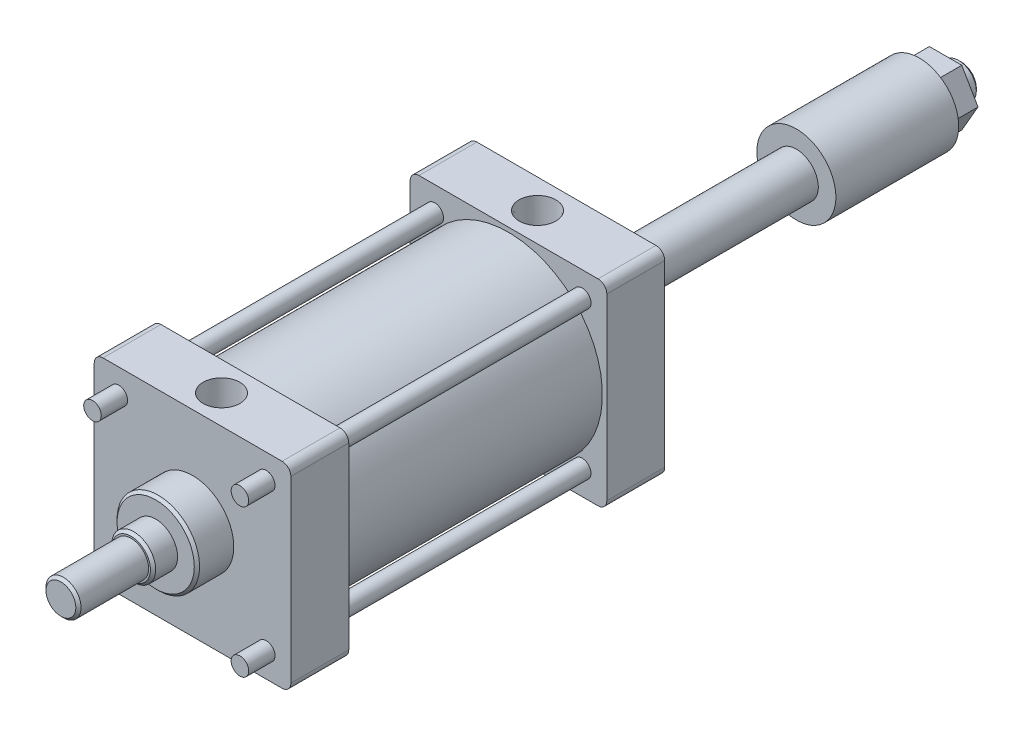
ISO-10303-21;
HEADER;
FILE_DESCRIPTION(('STEP AP214'),'2;1');
FILE_NAME('part.step','',(''),(''),'','','');
FILE_SCHEMA(('AUTOMOTIVE_DESIGN { 1 0 10303 214 1 1 1 1 }'));
ENDSEC;
DATA;
#1=APPLICATION_CONTEXT('core data for automotive mechanical design processes');
#2=APPLICATION_PROTOCOL_DEFINITION('international standard','automotive_design',2000,#1);
#3=PRODUCT_CONTEXT('',#1,'mechanical');
#4=PRODUCT('Part','Part','',(#3));
#5=PRODUCT_RELATED_PRODUCT_CATEGORY('part','',(#4));
#6=PRODUCT_DEFINITION_FORMATION('','',#4);
#7=PRODUCT_DEFINITION_CONTEXT('part definition',#1,'design');
#8=PRODUCT_DEFINITION('design','',#6,#7);
#9=PRODUCT_DEFINITION_SHAPE('','',#8);
#10=(LENGTH_UNIT() NAMED_UNIT(*) SI_UNIT(.MILLI.,.METRE.));
#11=(NAMED_UNIT(*) PLANE_ANGLE_UNIT() SI_UNIT($,.RADIAN.));
#12=(NAMED_UNIT(*) SI_UNIT($,.STERADIAN.) SOLID_ANGLE_UNIT());
#13=UNCERTAINTY_MEASURE_WITH_UNIT(LENGTH_MEASURE(1.E-05),#10,'distance_accuracy_value','');
#14=(GEOMETRIC_REPRESENTATION_CONTEXT(3) GLOBAL_UNCERTAINTY_ASSIGNED_CONTEXT((#13)) GLOBAL_UNIT_ASSIGNED_CONTEXT((#10,
#11,#12)) REPRESENTATION_CONTEXT('',''));
#15=CARTESIAN_POINT('',(0.,0.,0.));
#16=DIRECTION('',(0.,0.,1.));
#17=DIRECTION('',(1.,0.,0.));
#18=AXIS2_PLACEMENT_3D('',#15,#16,#17);
#19=CARTESIAN_POINT('',(51.,51.,-180.));
#20=DIRECTION('',(0.,0.,-1.));
#21=DIRECTION('',(-1.,0.,0.));
#22=AXIS2_PLACEMENT_3D('',#19,#20,#21);
#23=PLANE('',#22);
#24=CARTESIAN_POINT('',(-42.0000000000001,-41.9999999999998,-180.));
#25=DIRECTION('',(0.,0.,-1.));
#26=DIRECTION('',(-1.,0.,0.));
#27=AXIS2_PLACEMENT_3D('',#24,#25,#26);
#28=CIRCLE('',#27,5.);
#29=CARTESIAN_POINT('',(-47.0000000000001,-41.9999999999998,-180.));
#30=VERTEX_POINT('',#29);
#31=EDGE_CURVE('E11',#30,#30,#28,.F.);
#32=ORIENTED_EDGE('',*,*,#31,.F.);
#33=EDGE_LOOP('',(#32));
#34=FACE_BOUND('',#33,.T.);
#35=ADVANCED_FACE('F43',(#34),#23,.T.);
#36=CARTESIAN_POINT('',(-42.0000000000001,-41.9999999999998,-194.142135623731));
#37=DIRECTION('',(0.,0.,1.));
#38=DIRECTION('',(1.,0.,0.));
#39=AXIS2_PLACEMENT_3D('',#36,#37,#38);
#40=CYLINDRICAL_SURFACE('',#39,5.);
#41=ORIENTED_EDGE('',*,*,#31,.T.);
#42=EDGE_LOOP('',(#41));
#43=FACE_BOUND('',#42,.T.);
#44=CARTESIAN_POINT('',(-42.0000000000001,-41.9999999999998,48.));
#45=DIRECTION('',(0.,0.,1.));
#46=DIRECTION('',(1.,0.,0.));
#47=AXIS2_PLACEMENT_3D('',#44,#45,#46);
#48=CIRCLE('',#47,5.);
#49=CARTESIAN_POINT('',(-37.0000000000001,-41.9999999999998,48.));
#50=VERTEX_POINT('',#49);
#51=EDGE_CURVE('E49',#50,#50,#48,.T.);
#52=ORIENTED_EDGE('',*,*,#51,.F.);
#53=EDGE_LOOP('',(#52));
#54=FACE_BOUND('',#53,.T.);
#55=ADVANCED_FACE('F57',(#43,#54),#40,.T.);
#56=CARTESIAN_POINT('',(-42.0000000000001,-41.9999999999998,48.));
#57=DIRECTION('',(0.,0.,1.));
#58=DIRECTION('',(1.,0.,0.));
#59=AXIS2_PLACEMENT_3D('',#56,#57,#58);
#60=PLANE('',#59);
#61=ORIENTED_EDGE('',*,*,#51,.T.);
#62=EDGE_LOOP('',(#61));
#63=FACE_BOUND('',#62,.T.);
#64=ADVANCED_FACE('F55',(#63),#60,.T.);
#65=CLOSED_SHELL('',(#35,#55,#64));
#66=MANIFOLD_SOLID_BREP('B2',#65);
#67=CARTESIAN_POINT('',(51.,51.,-180.));
#68=DIRECTION('',(0.,0.,-1.));
#69=DIRECTION('',(-1.,0.,0.));
#70=AXIS2_PLACEMENT_3D('',#67,#68,#69);
#71=PLANE('',#70);
#72=CARTESIAN_POINT('',(42.,-42.,-180.));
#73=DIRECTION('',(0.,0.,-1.));
#74=DIRECTION('',(-1.,0.,0.));
#75=AXIS2_PLACEMENT_3D('',#72,#73,#74);
#76=CIRCLE('',#75,5.);
#77=CARTESIAN_POINT('',(37.,-42.,-180.));
#78=VERTEX_POINT('',#77);
#79=EDGE_CURVE('E42',#78,#78,#76,.F.);
#80=ORIENTED_EDGE('',*,*,#79,.F.);
#81=EDGE_LOOP('',(#80));
#82=FACE_BOUND('',#81,.T.);
#83=ADVANCED_FACE('F91',(#82),#71,.T.);
#84=CARTESIAN_POINT('',(42.,-42.,-194.142135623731));
#85=DIRECTION('',(0.,0.,1.));
#86=DIRECTION('',(1.,0.,0.));
#87=AXIS2_PLACEMENT_3D('',#84,#85,#86);
#88=CYLINDRICAL_SURFACE('',#87,5.);
#89=ORIENTED_EDGE('',*,*,#79,.T.);
#90=EDGE_LOOP('',(#89));
#91=FACE_BOUND('',#90,.T.);
#92=CARTESIAN_POINT('',(42.,-42.,48.));
#93=DIRECTION('',(0.,0.,1.));
#94=DIRECTION('',(1.,0.,0.));
#95=AXIS2_PLACEMENT_3D('',#92,#93,#94);
#96=CIRCLE('',#95,5.);
#97=CARTESIAN_POINT('',(47.,-42.,48.));
#98=VERTEX_POINT('',#97);
#99=EDGE_CURVE('E97',#98,#98,#96,.T.);
#100=ORIENTED_EDGE('',*,*,#99,.F.);
#101=EDGE_LOOP('',(#100));
#102=FACE_BOUND('',#101,.T.);
#103=ADVANCED_FACE('F105',(#91,#102),#88,.T.);
#104=CARTESIAN_POINT('',(42.,-42.,48.));
#105=DIRECTION('',(0.,0.,1.));
#106=DIRECTION('',(1.,0.,0.));
#107=AXIS2_PLACEMENT_3D('',#104,#105,#106);
#108=PLANE('',#107);
#109=ORIENTED_EDGE('',*,*,#99,.T.);
#110=EDGE_LOOP('',(#109));
#111=FACE_BOUND('',#110,.T.);
#112=ADVANCED_FACE('F103',(#111),#108,.T.);
#113=CLOSED_SHELL('',(#83,#103,#112));
#114=MANIFOLD_SOLID_BREP('B6',#113);
#115=CARTESIAN_POINT('',(51.,51.,-180.));
#116=DIRECTION('',(0.,0.,-1.));
#117=DIRECTION('',(-1.,0.,0.));
#118=AXIS2_PLACEMENT_3D('',#115,#116,#117);
#119=PLANE('',#118);
#120=CARTESIAN_POINT('',(42.0000000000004,41.9999999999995,-180.));
#121=DIRECTION('',(0.,0.,-1.));
#122=DIRECTION('',(-1.,0.,0.));
#123=AXIS2_PLACEMENT_3D('',#120,#121,#122);
#124=CIRCLE('',#123,4.99999999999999);
#125=CARTESIAN_POINT('',(37.0000000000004,41.9999999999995,-180.));
#126=VERTEX_POINT('',#125);
#127=EDGE_CURVE('E90',#126,#126,#124,.F.);
#128=ORIENTED_EDGE('',*,*,#127,.F.);
#129=EDGE_LOOP('',(#128));
#130=FACE_BOUND('',#129,.T.);
#131=ADVANCED_FACE('F139',(#130),#119,.T.);
#132=CARTESIAN_POINT('',(42.0000000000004,41.9999999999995,-194.142135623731));
#133=DIRECTION('',(0.,0.,1.));
#134=DIRECTION('',(1.,0.,0.));
#135=AXIS2_PLACEMENT_3D('',#132,#133,#134);
#136=CYLINDRICAL_SURFACE('',#135,4.99999999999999);
#137=ORIENTED_EDGE('',*,*,#127,.T.);
#138=EDGE_LOOP('',(#137));
#139=FACE_BOUND('',#138,.T.);
#140=CARTESIAN_POINT('',(42.0000000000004,41.9999999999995,48.));
#141=DIRECTION('',(0.,0.,1.));
#142=DIRECTION('',(1.,0.,0.));
#143=AXIS2_PLACEMENT_3D('',#140,#141,#142);
#144=CIRCLE('',#143,4.99999999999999);
#145=CARTESIAN_POINT('',(47.0000000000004,41.9999999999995,48.));
#146=VERTEX_POINT('',#145);
#147=EDGE_CURVE('E145',#146,#146,#144,.T.);
#148=ORIENTED_EDGE('',*,*,#147,.F.);
#149=EDGE_LOOP('',(#148));
#150=FACE_BOUND('',#149,.T.);
#151=ADVANCED_FACE('F153',(#139,#150),#136,.T.);
#152=CARTESIAN_POINT('',(42.0000000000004,41.9999999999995,48.));
#153=DIRECTION('',(0.,0.,1.));
#154=DIRECTION('',(1.,0.,0.));
#155=AXIS2_PLACEMENT_3D('',#152,#153,#154);
#156=PLANE('',#155);
#157=ORIENTED_EDGE('',*,*,#147,.T.);
#158=EDGE_LOOP('',(#157));
#159=FACE_BOUND('',#158,.T.);
#160=ADVANCED_FACE('F151',(#159),#156,.T.);
#161=CLOSED_SHELL('',(#131,#151,#160));
#162=MANIFOLD_SOLID_BREP('B37',#161);
#163=CARTESIAN_POINT('',(51.,51.,-180.));
#164=DIRECTION('',(0.,0.,-1.));
#165=DIRECTION('',(-1.,0.,0.));
#166=AXIS2_PLACEMENT_3D('',#163,#164,#165);
#167=PLANE('',#166);
#168=CARTESIAN_POINT('',(-41.9999999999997,42.0000000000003,-180.));
#169=DIRECTION('',(0.,0.,-1.));
#170=DIRECTION('',(-1.,0.,0.));
#171=AXIS2_PLACEMENT_3D('',#168,#169,#170);
#172=CIRCLE('',#171,4.99999999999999);
#173=CARTESIAN_POINT('',(-46.9999999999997,42.0000000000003,-180.));
#174=VERTEX_POINT('',#173);
#175=EDGE_CURVE('E138',#174,#174,#172,.F.);
#176=ORIENTED_EDGE('',*,*,#175,.F.);
#177=EDGE_LOOP('',(#176));
#178=FACE_BOUND('',#177,.T.);
#179=ADVANCED_FACE('F188',(#178),#167,.T.);
#180=CARTESIAN_POINT('',(-41.9999999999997,42.0000000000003,-194.142135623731));
#181=DIRECTION('',(0.,0.,1.));
#182=DIRECTION('',(1.,0.,0.));
#183=AXIS2_PLACEMENT_3D('',#180,#181,#182);
#184=CYLINDRICAL_SURFACE('',#183,4.99999999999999);
#185=ORIENTED_EDGE('',*,*,#175,.T.);
#186=EDGE_LOOP('',(#185));
#187=FACE_BOUND('',#186,.T.);
#188=CARTESIAN_POINT('',(-41.9999999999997,42.0000000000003,48.));
#189=DIRECTION('',(0.,0.,1.));
#190=DIRECTION('',(1.,0.,0.));
#191=AXIS2_PLACEMENT_3D('',#188,#189,#190);
#192=CIRCLE('',#191,4.99999999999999);
#193=CARTESIAN_POINT('',(-36.9999999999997,42.0000000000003,48.));
#194=VERTEX_POINT('',#193);
#195=EDGE_CURVE('E194',#194,#194,#192,.T.);
#196=ORIENTED_EDGE('',*,*,#195,.F.);
#197=EDGE_LOOP('',(#196));
#198=FACE_BOUND('',#197,.T.);
#199=ADVANCED_FACE('F202',(#187,#198),#184,.T.);
#200=CARTESIAN_POINT('',(-41.9999999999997,42.0000000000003,48.));
#201=DIRECTION('',(0.,0.,1.));
#202=DIRECTION('',(1.,0.,0.));
#203=AXIS2_PLACEMENT_3D('',#200,#201,#202);
#204=PLANE('',#203);
#205=ORIENTED_EDGE('',*,*,#195,.T.);
#206=EDGE_LOOP('',(#205));
#207=FACE_BOUND('',#206,.T.);
#208=ADVANCED_FACE('F200',(#207),#204,.T.);
#209=CLOSED_SHELL('',(#179,#199,#208));
#210=MANIFOLD_SOLID_BREP('B85',#209);
#211=CARTESIAN_POINT('',(0.,0.,-381.));
#212=DIRECTION('',(0.,0.,-1.));
#213=DIRECTION('',(-1.,0.,0.));
#214=AXIS2_PLACEMENT_3D('',#211,#212,#213);
#215=PLANE('',#214);
#216=CARTESIAN_POINT('',(0.,0.,-381.));
#217=DIRECTION('',(0.,0.,-1.));
#218=DIRECTION('',(-1.,0.,0.));
#219=AXIS2_PLACEMENT_3D('',#216,#217,#218);
#220=CIRCLE('',#219,22.5);
#221=CARTESIAN_POINT('',(-22.5,0.,-381.));
#222=VERTEX_POINT('',#221);
#223=EDGE_CURVE('E974',#222,#222,#220,.T.);
#224=ORIENTED_EDGE('',*,*,#223,.T.);
#225=EDGE_LOOP('',(#224));
#226=FACE_BOUND('',#225,.T.);
#227=DIRECTION('',(0.5,0.866025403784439,0.));
#228=VECTOR('',#227,1.);
#229=CARTESIAN_POINT('',(-18.475208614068,0.,-381.));
#230=LINE('',#229,#228);
#231=CARTESIAN_POINT('',(-18.475208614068,0.,-381.));
#232=VERTEX_POINT('',#231);
#233=CARTESIAN_POINT('',(-9.23760430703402,16.,-381.));
#234=VERTEX_POINT('',#233);
#235=EDGE_CURVE('E950',#232,#234,#230,.T.);
#236=ORIENTED_EDGE('',*,*,#235,.F.);
#237=DIRECTION('',(-0.5,0.866025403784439,0.));
#238=VECTOR('',#237,1.);
#239=CARTESIAN_POINT('',(-9.23760430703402,-16.,-381.));
#240=LINE('',#239,#238);
#241=CARTESIAN_POINT('',(-9.23760430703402,-16.,-381.));
#242=VERTEX_POINT('',#241);
#243=EDGE_CURVE('E932',#242,#232,#240,.T.);
#244=ORIENTED_EDGE('',*,*,#243,.F.);
#245=DIRECTION('',(-1.,0.,0.));
#246=VECTOR('',#245,1.);
#247=CARTESIAN_POINT('',(9.23760430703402,-16.,-381.));
#248=LINE('',#247,#246);
#249=CARTESIAN_POINT('',(9.23760430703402,-16.,-381.));
#250=VERTEX_POINT('',#249);
#251=EDGE_CURVE('E937',#250,#242,#248,.T.);
#252=ORIENTED_EDGE('',*,*,#251,.F.);
#253=DIRECTION('',(-0.5,-0.866025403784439,0.));
#254=VECTOR('',#253,1.);
#255=CARTESIAN_POINT('',(18.475208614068,0.,-381.));
#256=LINE('',#255,#254);
#257=CARTESIAN_POINT('',(18.475208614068,0.,-381.));
#258=VERTEX_POINT('',#257);
#259=EDGE_CURVE('E956',#258,#250,#256,.T.);
#260=ORIENTED_EDGE('',*,*,#259,.F.);
#261=DIRECTION('',(0.5,-0.866025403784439,0.));
#262=VECTOR('',#261,1.);
#263=CARTESIAN_POINT('',(9.23760430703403,16.,-381.));
#264=LINE('',#263,#262);
#265=CARTESIAN_POINT('',(9.23760430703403,16.,-381.));
#266=VERTEX_POINT('',#265);
#267=EDGE_CURVE('E954',#266,#258,#264,.T.);
#268=ORIENTED_EDGE('',*,*,#267,.F.);
#269=DIRECTION('',(1.,0.,0.));
#270=VECTOR('',#269,1.);
#271=CARTESIAN_POINT('',(-9.23760430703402,16.,-381.));
#272=LINE('',#271,#270);
#273=EDGE_CURVE('E952',#234,#266,#272,.T.);
#274=ORIENTED_EDGE('',*,*,#273,.F.);
#275=EDGE_LOOP('',(#236,#244,#252,#260,#268,#274));
#276=FACE_BOUND('',#275,.T.);
#277=ADVANCED_FACE('F229',(#226,#276),#215,.T.);
#278=CARTESIAN_POINT('',(51.,51.,33.));
#279=DIRECTION('',(0.,0.,-1.));
#280=DIRECTION('',(-1.,0.,0.));
#281=AXIS2_PLACEMENT_3D('',#278,#279,#280);
#282=PLANE('',#281);
#283=CARTESIAN_POINT('',(0.,0.,33.));
#284=DIRECTION('',(0.,0.,-1.));
#285=DIRECTION('',(-1.,0.,0.));
#286=AXIS2_PLACEMENT_3D('',#283,#284,#285);
#287=CIRCLE('',#286,23.5);
#288=CARTESIAN_POINT('',(-23.5,0.,33.));
#289=VERTEX_POINT('',#288);
#290=EDGE_CURVE('E371',#289,#289,#287,.F.);
#291=ORIENTED_EDGE('',*,*,#290,.F.);
#292=EDGE_LOOP('',(#291));
#293=FACE_BOUND('',#292,.T.);
#294=CARTESIAN_POINT('',(51.,51.,33.));
#295=DIRECTION('',(0.,0.,1.));
#296=DIRECTION('',(-1.,0.,0.));
#297=AXIS2_PLACEMENT_3D('',#294,#295,#296);
#298=CIRCLE('',#297,5.);
#299=CARTESIAN_POINT('',(56.,51.,33.));
#300=VERTEX_POINT('',#299);
#301=CARTESIAN_POINT('',(51.,56.,33.));
#302=VERTEX_POINT('',#301);
#303=EDGE_CURVE('E356',#300,#302,#298,.T.);
#304=ORIENTED_EDGE('',*,*,#303,.T.);
#305=DIRECTION('',(-1.,0.,0.));
#306=VECTOR('',#305,1.);
#307=CARTESIAN_POINT('',(51.,56.,33.));
#308=LINE('',#307,#306);
#309=CARTESIAN_POINT('',(-51.,56.,33.));
#310=VERTEX_POINT('',#309);
#311=EDGE_CURVE('E295',#302,#310,#308,.T.);
#312=ORIENTED_EDGE('',*,*,#311,.T.);
#313=CARTESIAN_POINT('',(-51.,51.,33.));
#314=DIRECTION('',(0.,0.,1.));
#315=DIRECTION('',(-1.,0.,0.));
#316=AXIS2_PLACEMENT_3D('',#313,#314,#315);
#317=CIRCLE('',#316,5.);
#318=CARTESIAN_POINT('',(-56.,51.,33.));
#319=VERTEX_POINT('',#318);
#320=EDGE_CURVE('E760',#310,#319,#317,.T.);
#321=ORIENTED_EDGE('',*,*,#320,.T.);
#322=DIRECTION('',(0.,-1.,0.));
#323=VECTOR('',#322,1.);
#324=CARTESIAN_POINT('',(-56.,51.,33.));
#325=LINE('',#324,#323);
#326=CARTESIAN_POINT('',(-56.,-51.,33.));
#327=VERTEX_POINT('',#326);
#328=EDGE_CURVE('E762',#319,#327,#325,.T.);
#329=ORIENTED_EDGE('',*,*,#328,.T.);
#330=CARTESIAN_POINT('',(-51.,-51.,33.));
#331=DIRECTION('',(0.,0.,1.));
#332=DIRECTION('',(1.,0.,0.));
#333=AXIS2_PLACEMENT_3D('',#330,#331,#332);
#334=CIRCLE('',#333,5.);
#335=CARTESIAN_POINT('',(-51.,-56.,33.));
#336=VERTEX_POINT('',#335);
#337=EDGE_CURVE('E319',#327,#336,#334,.T.);
#338=ORIENTED_EDGE('',*,*,#337,.T.);
#339=DIRECTION('',(1.,0.,0.));
#340=VECTOR('',#339,1.);
#341=CARTESIAN_POINT('',(51.,-56.,33.));
#342=LINE('',#341,#340);
#343=CARTESIAN_POINT('',(51.,-56.,33.));
#344=VERTEX_POINT('',#343);
#345=EDGE_CURVE('E311',#336,#344,#342,.T.);
#346=ORIENTED_EDGE('',*,*,#345,.T.);
#347=CARTESIAN_POINT('',(51.,-51.,33.));
#348=DIRECTION('',(0.,0.,1.));
#349=DIRECTION('',(-1.,0.,0.));
#350=AXIS2_PLACEMENT_3D('',#347,#348,#349);
#351=CIRCLE('',#350,5.);
#352=CARTESIAN_POINT('',(56.,-51.,33.));
#353=VERTEX_POINT('',#352);
#354=EDGE_CURVE('E316',#344,#353,#351,.T.);
#355=ORIENTED_EDGE('',*,*,#354,.T.);
#356=DIRECTION('',(0.,1.,0.));
#357=VECTOR('',#356,1.);
#358=CARTESIAN_POINT('',(56.,51.,33.));
#359=LINE('',#358,#357);
#360=EDGE_CURVE('E253',#353,#300,#359,.T.);
#361=ORIENTED_EDGE('',*,*,#360,.T.);
#362=EDGE_LOOP('',(#304,#312,#321,#329,#338,#346,#355,#361));
#363=FACE_BOUND('',#362,.T.);
#364=CARTESIAN_POINT('',(42.,-42.,33.));
#365=DIRECTION('',(0.,0.,1.));
#366=DIRECTION('',(1.,0.,0.));
#367=AXIS2_PLACEMENT_3D('',#364,#365,#366);
#368=CIRCLE('',#367,5.);
#369=CARTESIAN_POINT('',(47.,-42.,33.));
#370=VERTEX_POINT('',#369);
#371=EDGE_CURVE('E344',#370,#370,#368,.T.);
#372=ORIENTED_EDGE('',*,*,#371,.F.);
#373=EDGE_LOOP('',(#372));
#374=FACE_BOUND('',#373,.T.);
#375=CARTESIAN_POINT('',(-42.0000000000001,-41.9999999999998,33.));
#376=DIRECTION('',(0.,0.,1.));
#377=DIRECTION('',(1.,0.,0.));
#378=AXIS2_PLACEMENT_3D('',#375,#376,#377);
#379=CIRCLE('',#378,5.);
#380=CARTESIAN_POINT('',(-37.0000000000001,-41.9999999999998,33.));
#381=VERTEX_POINT('',#380);
#382=EDGE_CURVE('E748',#381,#381,#379,.T.);
#383=ORIENTED_EDGE('',*,*,#382,.F.);
#384=EDGE_LOOP('',(#383));
#385=FACE_BOUND('',#384,.T.);
#386=CARTESIAN_POINT('',(-41.9999999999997,42.0000000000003,33.));
#387=DIRECTION('',(0.,0.,1.));
#388=DIRECTION('',(1.,0.,0.));
#389=AXIS2_PLACEMENT_3D('',#386,#387,#388);
#390=CIRCLE('',#389,4.99999999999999);
#391=CARTESIAN_POINT('',(-36.9999999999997,42.0000000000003,33.));
#392=VERTEX_POINT('',#391);
#393=EDGE_CURVE('E742',#392,#392,#390,.T.);
#394=ORIENTED_EDGE('',*,*,#393,.F.);
#395=EDGE_LOOP('',(#394));
#396=FACE_BOUND('',#395,.T.);
#397=CARTESIAN_POINT('',(42.0000000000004,41.9999999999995,33.));
#398=DIRECTION('',(0.,0.,1.));
#399=DIRECTION('',(1.,0.,0.));
#400=AXIS2_PLACEMENT_3D('',#397,#398,#399);
#401=CIRCLE('',#400,4.99999999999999);
#402=CARTESIAN_POINT('',(47.0000000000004,41.9999999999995,33.));
#403=VERTEX_POINT('',#402);
#404=EDGE_CURVE('E736',#403,#403,#401,.T.);
#405=ORIENTED_EDGE('',*,*,#404,.F.);
#406=EDGE_LOOP('',(#405));
#407=FACE_BOUND('',#406,.T.);
#408=ADVANCED_FACE('F313',(#293,#363,#374,#385,#396,#407),#282,.F.);
#409=CARTESIAN_POINT('',(51.,51.,0.));
#410=DIRECTION('',(0.,0.,-1.));
#411=DIRECTION('',(-1.,0.,0.));
#412=AXIS2_PLACEMENT_3D('',#409,#410,#411);
#413=PLANE('',#412);
#414=CARTESIAN_POINT('',(0.,0.,0.));
#415=DIRECTION('',(0.,0.,-1.));
#416=DIRECTION('',(-1.,0.,0.));
#417=AXIS2_PLACEMENT_3D('',#414,#415,#416);
#418=CIRCLE('',#417,53.5);
#419=CARTESIAN_POINT('',(-53.5,0.,0.));
#420=VERTEX_POINT('',#419);
#421=EDGE_CURVE('E723',#420,#420,#418,.T.);
#422=ORIENTED_EDGE('',*,*,#421,.F.);
#423=EDGE_LOOP('',(#422));
#424=FACE_BOUND('',#423,.T.);
#425=CARTESIAN_POINT('',(-41.9999999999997,42.0000000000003,0.));
#426=DIRECTION('',(0.,0.,1.));
#427=DIRECTION('',(1.,0.,0.));
#428=AXIS2_PLACEMENT_3D('',#425,#426,#427);
#429=CIRCLE('',#428,4.99999999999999);
#430=CARTESIAN_POINT('',(-36.9999999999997,42.0000000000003,0.));
#431=VERTEX_POINT('',#430);
#432=EDGE_CURVE('E739',#431,#431,#429,.T.);
#433=ORIENTED_EDGE('',*,*,#432,.T.);
#434=EDGE_LOOP('',(#433));
#435=FACE_BOUND('',#434,.T.);
#436=CARTESIAN_POINT('',(42.,-42.,0.));
#437=DIRECTION('',(0.,0.,1.));
#438=DIRECTION('',(1.,0.,0.));
#439=AXIS2_PLACEMENT_3D('',#436,#437,#438);
#440=CIRCLE('',#439,5.);
#441=CARTESIAN_POINT('',(47.,-42.,0.));
#442=VERTEX_POINT('',#441);
#443=EDGE_CURVE('E751',#442,#442,#440,.T.);
#444=ORIENTED_EDGE('',*,*,#443,.T.);
#445=EDGE_LOOP('',(#444));
#446=FACE_BOUND('',#445,.T.);
#447=CARTESIAN_POINT('',(51.,51.,0.));
#448=DIRECTION('',(0.,0.,1.));
#449=DIRECTION('',(-1.,0.,0.));
#450=AXIS2_PLACEMENT_3D('',#447,#448,#449);
#451=CIRCLE('',#450,5.);
#452=CARTESIAN_POINT('',(56.,51.,0.));
#453=VERTEX_POINT('',#452);
#454=CARTESIAN_POINT('',(51.,56.,0.));
#455=VERTEX_POINT('',#454);
#456=EDGE_CURVE('E340',#453,#455,#451,.T.);
#457=ORIENTED_EDGE('',*,*,#456,.F.);
#458=DIRECTION('',(0.,1.,0.));
#459=VECTOR('',#458,1.);
#460=CARTESIAN_POINT('',(56.,51.,0.));
#461=LINE('',#460,#459);
#462=CARTESIAN_POINT('',(56.,-51.,0.));
#463=VERTEX_POINT('',#462);
#464=EDGE_CURVE('E286',#463,#453,#461,.T.);
#465=ORIENTED_EDGE('',*,*,#464,.F.);
#466=CARTESIAN_POINT('',(51.,-51.,0.));
#467=DIRECTION('',(0.,0.,1.));
#468=DIRECTION('',(-1.,0.,0.));
#469=AXIS2_PLACEMENT_3D('',#466,#467,#468);
#470=CIRCLE('',#469,5.);
#471=CARTESIAN_POINT('',(51.,-56.,0.));
#472=VERTEX_POINT('',#471);
#473=EDGE_CURVE('E353',#472,#463,#470,.T.);
#474=ORIENTED_EDGE('',*,*,#473,.F.);
#475=DIRECTION('',(1.,0.,0.));
#476=VECTOR('',#475,1.);
#477=CARTESIAN_POINT('',(51.,-56.,0.));
#478=LINE('',#477,#476);
#479=CARTESIAN_POINT('',(-51.,-56.,0.));
#480=VERTEX_POINT('',#479);
#481=EDGE_CURVE('E328',#480,#472,#478,.T.);
#482=ORIENTED_EDGE('',*,*,#481,.F.);
#483=CARTESIAN_POINT('',(-51.,-51.,0.));
#484=DIRECTION('',(0.,0.,1.));
#485=DIRECTION('',(1.,0.,0.));
#486=AXIS2_PLACEMENT_3D('',#483,#484,#485);
#487=CIRCLE('',#486,5.);
#488=CARTESIAN_POINT('',(-56.,-51.,0.));
#489=VERTEX_POINT('',#488);
#490=EDGE_CURVE('E350',#489,#480,#487,.T.);
#491=ORIENTED_EDGE('',*,*,#490,.F.);
#492=DIRECTION('',(0.,-1.,0.));
#493=VECTOR('',#492,1.);
#494=CARTESIAN_POINT('',(-56.,51.,0.));
#495=LINE('',#494,#493);
#496=CARTESIAN_POINT('',(-56.,51.,0.));
#497=VERTEX_POINT('',#496);
#498=EDGE_CURVE('E348',#497,#489,#495,.T.);
#499=ORIENTED_EDGE('',*,*,#498,.F.);
#500=CARTESIAN_POINT('',(-51.,51.,0.));
#501=DIRECTION('',(0.,0.,1.));
#502=DIRECTION('',(-1.,0.,0.));
#503=AXIS2_PLACEMENT_3D('',#500,#501,#502);
#504=CIRCLE('',#503,5.);
#505=CARTESIAN_POINT('',(-51.,56.,0.));
#506=VERTEX_POINT('',#505);
#507=EDGE_CURVE('E346',#506,#497,#504,.T.);
#508=ORIENTED_EDGE('',*,*,#507,.F.);
#509=DIRECTION('',(-1.,0.,0.));
#510=VECTOR('',#509,1.);
#511=CARTESIAN_POINT('',(51.,56.,0.));
#512=LINE('',#511,#510);
#513=EDGE_CURVE('E343',#455,#506,#512,.T.);
#514=ORIENTED_EDGE('',*,*,#513,.F.);
#515=EDGE_LOOP('',(#457,#465,#474,#482,#491,#499,#508,#514));
#516=FACE_BOUND('',#515,.T.);
#517=CARTESIAN_POINT('',(-42.0000000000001,-41.9999999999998,0.));
#518=DIRECTION('',(0.,0.,1.));
#519=DIRECTION('',(1.,0.,0.));
#520=AXIS2_PLACEMENT_3D('',#517,#518,#519);
#521=CIRCLE('',#520,5.);
#522=CARTESIAN_POINT('',(-37.0000000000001,-41.9999999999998,0.));
#523=VERTEX_POINT('',#522);
#524=EDGE_CURVE('E745',#523,#523,#521,.T.);
#525=ORIENTED_EDGE('',*,*,#524,.T.);
#526=EDGE_LOOP('',(#525));
#527=FACE_BOUND('',#526,.T.);
#528=CARTESIAN_POINT('',(42.0000000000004,41.9999999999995,0.));
#529=DIRECTION('',(0.,0.,1.));
#530=DIRECTION('',(1.,0.,0.));
#531=AXIS2_PLACEMENT_3D('',#528,#529,#530);
#532=CIRCLE('',#531,4.99999999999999);
#533=CARTESIAN_POINT('',(47.0000000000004,41.9999999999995,0.));
#534=VERTEX_POINT('',#533);
#535=EDGE_CURVE('E735',#534,#534,#532,.T.);
#536=ORIENTED_EDGE('',*,*,#535,.T.);
#537=EDGE_LOOP('',(#536));
#538=FACE_BOUND('',#537,.T.);
#539=ADVANCED_FACE('F423',(#424,#435,#446,#516,#527,#538),#413,.T.);
#540=CARTESIAN_POINT('',(51.,51.,33.));
#541=DIRECTION('',(0.,0.,-1.));
#542=DIRECTION('',(-1.,0.,0.));
#543=AXIS2_PLACEMENT_3D('',#540,#541,#542);
#544=CYLINDRICAL_SURFACE('',#543,5.);
#545=ORIENTED_EDGE('',*,*,#456,.T.);
#546=DIRECTION('',(0.,0.,-1.));
#547=VECTOR('',#546,1.);
#548=CARTESIAN_POINT('',(51.,56.,33.));
#549=LINE('',#548,#547);
#550=EDGE_CURVE('E369',#302,#455,#549,.T.);
#551=ORIENTED_EDGE('',*,*,#550,.F.);
#552=ORIENTED_EDGE('',*,*,#303,.F.);
#553=DIRECTION('',(0.,0.,-1.));
#554=VECTOR('',#553,1.);
#555=CARTESIAN_POINT('',(56.,51.,33.));
#556=LINE('',#555,#554);
#557=EDGE_CURVE('E336',#300,#453,#556,.T.);
#558=ORIENTED_EDGE('',*,*,#557,.T.);
#559=EDGE_LOOP('',(#545,#551,#552,#558));
#560=FACE_BOUND('',#559,.T.);
#561=ADVANCED_FACE('F566',(#560),#544,.T.);
#562=CARTESIAN_POINT('',(51.,56.,33.));
#563=DIRECTION('',(0.,-1.,0.));
#564=DIRECTION('',(0.,0.,-1.));
#565=AXIS2_PLACEMENT_3D('',#562,#563,#564);
#566=PLANE('',#565);
#567=CARTESIAN_POINT('',(0.,56.,16.5));
#568=DIRECTION('',(0.,1.,0.));
#569=DIRECTION('',(0.,0.,1.));
#570=AXIS2_PLACEMENT_3D('',#567,#568,#569);
#571=CIRCLE('',#570,10.4775);
#572=CARTESIAN_POINT('',(0.,56.,26.9775));
#573=VERTEX_POINT('',#572);
#574=EDGE_CURVE('E1419',#573,#573,#571,.T.);
#575=ORIENTED_EDGE('',*,*,#574,.F.);
#576=EDGE_LOOP('',(#575));
#577=FACE_BOUND('',#576,.T.);
#578=ORIENTED_EDGE('',*,*,#513,.T.);
#579=DIRECTION('',(0.,0.,-1.));
#580=VECTOR('',#579,1.);
#581=CARTESIAN_POINT('',(-51.,56.,33.));
#582=LINE('',#581,#580);
#583=EDGE_CURVE('E366',#310,#506,#582,.T.);
#584=ORIENTED_EDGE('',*,*,#583,.F.);
#585=ORIENTED_EDGE('',*,*,#311,.F.);
#586=ORIENTED_EDGE('',*,*,#550,.T.);
#587=EDGE_LOOP('',(#578,#584,#585,#586));
#588=FACE_BOUND('',#587,.T.);
#589=ADVANCED_FACE('F585',(#577,#588),#566,.F.);
#590=CARTESIAN_POINT('',(-51.,51.,33.));
#591=DIRECTION('',(0.,0.,-1.));
#592=DIRECTION('',(-1.,0.,0.));
#593=AXIS2_PLACEMENT_3D('',#590,#591,#592);
#594=CYLINDRICAL_SURFACE('',#593,5.);
#595=ORIENTED_EDGE('',*,*,#507,.T.);
#596=DIRECTION('',(0.,0.,-1.));
#597=VECTOR('',#596,1.);
#598=CARTESIAN_POINT('',(-56.,51.,33.));
#599=LINE('',#598,#597);
#600=EDGE_CURVE('E363',#319,#497,#599,.T.);
#601=ORIENTED_EDGE('',*,*,#600,.F.);
#602=ORIENTED_EDGE('',*,*,#320,.F.);
#603=ORIENTED_EDGE('',*,*,#583,.T.);
#604=EDGE_LOOP('',(#595,#601,#602,#603));
#605=FACE_BOUND('',#604,.T.);
#606=ADVANCED_FACE('F581',(#605),#594,.T.);
#607=CARTESIAN_POINT('',(-56.,51.,33.));
#608=DIRECTION('',(1.,0.,0.));
#609=DIRECTION('',(0.,1.,0.));
#610=AXIS2_PLACEMENT_3D('',#607,#608,#609);
#611=PLANE('',#610);
#612=ORIENTED_EDGE('',*,*,#498,.T.);
#613=DIRECTION('',(0.,0.,-1.));
#614=VECTOR('',#613,1.);
#615=CARTESIAN_POINT('',(-56.,-51.,33.));
#616=LINE('',#615,#614);
#617=EDGE_CURVE('E360',#327,#489,#616,.T.);
#618=ORIENTED_EDGE('',*,*,#617,.F.);
#619=ORIENTED_EDGE('',*,*,#328,.F.);
#620=ORIENTED_EDGE('',*,*,#600,.T.);
#621=EDGE_LOOP('',(#612,#618,#619,#620));
#622=FACE_BOUND('',#621,.T.);
#623=ADVANCED_FACE('F577',(#622),#611,.F.);
#624=CARTESIAN_POINT('',(-51.,-51.,33.));
#625=DIRECTION('',(0.,0.,-1.));
#626=DIRECTION('',(-1.,0.,0.));
#627=AXIS2_PLACEMENT_3D('',#624,#625,#626);
#628=CYLINDRICAL_SURFACE('',#627,5.);
#629=ORIENTED_EDGE('',*,*,#490,.T.);
#630=DIRECTION('',(0.,0.,-1.));
#631=VECTOR('',#630,1.);
#632=CARTESIAN_POINT('',(-51.,-56.,33.));
#633=LINE('',#632,#631);
#634=EDGE_CURVE('E331',#336,#480,#633,.T.);
#635=ORIENTED_EDGE('',*,*,#634,.F.);
#636=ORIENTED_EDGE('',*,*,#337,.F.);
#637=ORIENTED_EDGE('',*,*,#617,.T.);
#638=EDGE_LOOP('',(#629,#635,#636,#637));
#639=FACE_BOUND('',#638,.T.);
#640=ADVANCED_FACE('F574',(#639),#628,.T.);
#641=CARTESIAN_POINT('',(51.,-56.,33.));
#642=DIRECTION('',(0.,1.,0.));
#643=DIRECTION('',(0.,0.,1.));
#644=AXIS2_PLACEMENT_3D('',#641,#642,#643);
#645=PLANE('',#644);
#646=ORIENTED_EDGE('',*,*,#481,.T.);
#647=DIRECTION('',(0.,0.,-1.));
#648=VECTOR('',#647,1.);
#649=CARTESIAN_POINT('',(51.,-56.,33.));
#650=LINE('',#649,#648);
#651=EDGE_CURVE('E325',#344,#472,#650,.T.);
#652=ORIENTED_EDGE('',*,*,#651,.F.);
#653=ORIENTED_EDGE('',*,*,#345,.F.);
#654=ORIENTED_EDGE('',*,*,#634,.T.);
#655=EDGE_LOOP('',(#646,#652,#653,#654));
#656=FACE_BOUND('',#655,.T.);
#657=ADVANCED_FACE('F326',(#656),#645,.F.);
#658=CARTESIAN_POINT('',(51.,-51.,33.));
#659=DIRECTION('',(0.,0.,-1.));
#660=DIRECTION('',(-1.,0.,0.));
#661=AXIS2_PLACEMENT_3D('',#658,#659,#660);
#662=CYLINDRICAL_SURFACE('',#661,5.);
#663=ORIENTED_EDGE('',*,*,#473,.T.);
#664=DIRECTION('',(0.,0.,-1.));
#665=VECTOR('',#664,1.);
#666=CARTESIAN_POINT('',(56.,-51.,33.));
#667=LINE('',#666,#665);
#668=EDGE_CURVE('E332',#353,#463,#667,.T.);
#669=ORIENTED_EDGE('',*,*,#668,.F.);
#670=ORIENTED_EDGE('',*,*,#354,.F.);
#671=ORIENTED_EDGE('',*,*,#651,.T.);
#672=EDGE_LOOP('',(#663,#669,#670,#671));
#673=FACE_BOUND('',#672,.T.);
#674=ADVANCED_FACE('F334',(#673),#662,.T.);
#675=CARTESIAN_POINT('',(56.,51.,33.));
#676=DIRECTION('',(-1.,0.,0.));
#677=DIRECTION('',(0.,-1.,0.));
#678=AXIS2_PLACEMENT_3D('',#675,#676,#677);
#679=PLANE('',#678);
#680=ORIENTED_EDGE('',*,*,#464,.T.);
#681=ORIENTED_EDGE('',*,*,#557,.F.);
#682=ORIENTED_EDGE('',*,*,#360,.F.);
#683=ORIENTED_EDGE('',*,*,#668,.T.);
#684=EDGE_LOOP('',(#680,#681,#682,#683));
#685=FACE_BOUND('',#684,.T.);
#686=ADVANCED_FACE('F561',(#685),#679,.F.);
#687=CARTESIAN_POINT('',(42.,-42.,33.));
#688=DIRECTION('',(0.,0.,-1.));
#689=DIRECTION('',(-1.,0.,0.));
#690=AXIS2_PLACEMENT_3D('',#687,#688,#689);
#691=CYLINDRICAL_SURFACE('',#690,5.);
#692=ORIENTED_EDGE('',*,*,#371,.T.);
#693=EDGE_LOOP('',(#692));
#694=FACE_BOUND('',#693,.T.);
#695=ORIENTED_EDGE('',*,*,#443,.F.);
#696=EDGE_LOOP('',(#695));
#697=FACE_BOUND('',#696,.T.);
#698=ADVANCED_FACE('F558',(#694,#697),#691,.F.);
#699=CARTESIAN_POINT('',(-42.0000000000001,-41.9999999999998,33.));
#700=DIRECTION('',(0.,0.,-1.));
#701=DIRECTION('',(-1.,0.,0.));
#702=AXIS2_PLACEMENT_3D('',#699,#700,#701);
#703=CYLINDRICAL_SURFACE('',#702,5.);
#704=ORIENTED_EDGE('',*,*,#382,.T.);
#705=EDGE_LOOP('',(#704));
#706=FACE_BOUND('',#705,.T.);
#707=ORIENTED_EDGE('',*,*,#524,.F.);
#708=EDGE_LOOP('',(#707));
#709=FACE_BOUND('',#708,.T.);
#710=ADVANCED_FACE('F554',(#706,#709),#703,.F.);
#711=CARTESIAN_POINT('',(-41.9999999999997,42.0000000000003,33.));
#712=DIRECTION('',(0.,0.,-1.));
#713=DIRECTION('',(-1.,0.,0.));
#714=AXIS2_PLACEMENT_3D('',#711,#712,#713);
#715=CYLINDRICAL_SURFACE('',#714,4.99999999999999);
#716=ORIENTED_EDGE('',*,*,#393,.T.);
#717=EDGE_LOOP('',(#716));
#718=FACE_BOUND('',#717,.T.);
#719=ORIENTED_EDGE('',*,*,#432,.F.);
#720=EDGE_LOOP('',(#719));
#721=FACE_BOUND('',#720,.T.);
#722=ADVANCED_FACE('F550',(#718,#721),#715,.F.);
#723=CARTESIAN_POINT('',(42.0000000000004,41.9999999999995,33.));
#724=DIRECTION('',(0.,0.,-1.));
#725=DIRECTION('',(-1.,0.,0.));
#726=AXIS2_PLACEMENT_3D('',#723,#724,#725);
#727=CYLINDRICAL_SURFACE('',#726,4.99999999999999);
#728=ORIENTED_EDGE('',*,*,#404,.T.);
#729=EDGE_LOOP('',(#728));
#730=FACE_BOUND('',#729,.T.);
#731=ORIENTED_EDGE('',*,*,#535,.F.);
#732=EDGE_LOOP('',(#731));
#733=FACE_BOUND('',#732,.T.);
#734=ADVANCED_FACE('F546',(#730,#733),#727,.F.);
#735=CARTESIAN_POINT('',(0.,0.,54.));
#736=DIRECTION('',(0.,0.,-1.));
#737=DIRECTION('',(-1.,0.,0.));
#738=AXIS2_PLACEMENT_3D('',#735,#736,#737);
#739=CYLINDRICAL_SURFACE('',#738,23.5);
#740=CARTESIAN_POINT('',(0.,0.,52.5000000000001));
#741=DIRECTION('',(0.,0.,1.));
#742=DIRECTION('',(1.,0.,0.));
#743=AXIS2_PLACEMENT_3D('',#740,#741,#742);
#744=CIRCLE('',#743,23.5);
#745=CARTESIAN_POINT('',(-23.5,0.,52.5000000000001));
#746=VERTEX_POINT('',#745);
#747=EDGE_CURVE('E389',#746,#746,#744,.F.);
#748=CARTESIAN_POINT('',(-23.5,0.,52.5000000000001));
#749=CARTESIAN_POINT('',(-23.5,0.,52.2968750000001));
#750=CARTESIAN_POINT('',(-23.5,0.,52.0937500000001));
#751=CARTESIAN_POINT('',(-23.5,0.,51.6875000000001));
#752=CARTESIAN_POINT('',(-23.5,0.,51.4843750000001));
#753=CARTESIAN_POINT('',(-23.5,0.,51.0781250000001));
#754=CARTESIAN_POINT('',(-23.5,0.,50.8750000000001));
#755=CARTESIAN_POINT('',(-23.5,0.,50.4687500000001));
#756=CARTESIAN_POINT('',(-23.5,0.,50.2656250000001));
#757=CARTESIAN_POINT('',(-23.5,0.,49.8593750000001));
#758=CARTESIAN_POINT('',(-23.5,0.,49.6562500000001));
#759=CARTESIAN_POINT('',(-23.5,0.,49.2500000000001));
#760=CARTESIAN_POINT('',(-23.5,0.,49.0468750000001));
#761=CARTESIAN_POINT('',(-23.5,0.,48.6406250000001));
#762=CARTESIAN_POINT('',(-23.5,0.,48.4375000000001));
#763=CARTESIAN_POINT('',(-23.5,0.,48.0312500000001));
#764=CARTESIAN_POINT('',(-23.5,0.,47.8281250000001));
#765=CARTESIAN_POINT('',(-23.5,0.,47.4218750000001));
#766=CARTESIAN_POINT('',(-23.5,0.,47.2187500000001));
#767=CARTESIAN_POINT('',(-23.5,0.,46.8125000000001));
#768=CARTESIAN_POINT('',(-23.5,0.,46.6093750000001));
#769=CARTESIAN_POINT('',(-23.5,0.,46.2031250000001));
#770=CARTESIAN_POINT('',(-23.5,0.,46.0000000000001));
#771=CARTESIAN_POINT('',(-23.5,0.,45.5937500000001));
#772=CARTESIAN_POINT('',(-23.5,0.,45.3906250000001));
#773=CARTESIAN_POINT('',(-23.5,0.,44.9843750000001));
#774=CARTESIAN_POINT('',(-23.5,0.,44.7812500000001));
#775=CARTESIAN_POINT('',(-23.5,0.,44.3750000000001));
#776=CARTESIAN_POINT('',(-23.5,0.,44.1718750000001));
#777=CARTESIAN_POINT('',(-23.5,0.,43.7656250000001));
#778=CARTESIAN_POINT('',(-23.5,0.,43.5625));
#779=CARTESIAN_POINT('',(-23.5,0.,43.1562500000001));
#780=CARTESIAN_POINT('',(-23.5,0.,42.953125));
#781=CARTESIAN_POINT('',(-23.5,0.,42.5468750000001));
#782=CARTESIAN_POINT('',(-23.5,0.,42.34375));
#783=CARTESIAN_POINT('',(-23.5,0.,41.9375));
#784=CARTESIAN_POINT('',(-23.5,0.,41.734375));
#785=CARTESIAN_POINT('',(-23.5,0.,41.328125));
#786=CARTESIAN_POINT('',(-23.5,0.,41.125));
#787=CARTESIAN_POINT('',(-23.5,0.,40.71875));
#788=CARTESIAN_POINT('',(-23.5,0.,40.515625));
#789=CARTESIAN_POINT('',(-23.5,0.,40.109375));
#790=CARTESIAN_POINT('',(-23.5,0.,39.90625));
#791=CARTESIAN_POINT('',(-23.5,0.,39.5));
#792=CARTESIAN_POINT('',(-23.5,0.,39.296875));
#793=CARTESIAN_POINT('',(-23.5,0.,38.890625));
#794=CARTESIAN_POINT('',(-23.5,0.,38.6875));
#795=CARTESIAN_POINT('',(-23.5,0.,38.28125));
#796=CARTESIAN_POINT('',(-23.5,0.,38.078125));
#797=CARTESIAN_POINT('',(-23.5,0.,37.671875));
#798=CARTESIAN_POINT('',(-23.5,0.,37.46875));
#799=CARTESIAN_POINT('',(-23.5,0.,37.0625));
#800=CARTESIAN_POINT('',(-23.5,0.,36.859375));
#801=CARTESIAN_POINT('',(-23.5,0.,36.453125));
#802=CARTESIAN_POINT('',(-23.5,0.,36.25));
#803=CARTESIAN_POINT('',(-23.5,0.,35.84375));
#804=CARTESIAN_POINT('',(-23.5,0.,35.640625));
#805=CARTESIAN_POINT('',(-23.5,0.,35.234375));
#806=CARTESIAN_POINT('',(-23.5,0.,35.03125));
#807=CARTESIAN_POINT('',(-23.5,0.,34.625));
#808=CARTESIAN_POINT('',(-23.5,0.,34.421875));
#809=CARTESIAN_POINT('',(-23.5,0.,34.015625));
#810=CARTESIAN_POINT('',(-23.5,0.,33.8125));
#811=CARTESIAN_POINT('',(-23.5,0.,33.40625));
#812=CARTESIAN_POINT('',(-23.5,0.,33.203125));
#813=CARTESIAN_POINT('',(-23.5,0.,33.));
#814=B_SPLINE_CURVE_WITH_KNOTS('',3,(#748,#749,#750,#751,#752,#753,#754,#755,#756,#757,#758,
#759,#760,#761,#762,#763,#764,#765,#766,#767,#768,#769,#770,#771,#772,#773,#774,#775,#776,#777,
#778,#779,#780,#781,#782,#783,#784,#785,#786,#787,#788,#789,#790,#791,#792,#793,#794,#795,#796,
#797,#798,#799,#800,#801,#802,#803,#804,#805,#806,#807,#808,#809,#810,#811,#812,#813),
.UNSPECIFIED.,.F.,.F.,(4,2,2,2,2,2,2,2,2,2,2,2,2,2,2,2,2,2,2,2,2,2,2,2,2,2,2,2,2,2,2,2,4),(0.,
0.609375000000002,1.21875,1.82812500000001,2.43750000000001,3.04687500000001,3.65625000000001,
4.26562500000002,4.87500000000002,5.48437500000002,6.09375000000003,6.70312500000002,
7.31250000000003,7.92187500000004,8.53125000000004,9.14062500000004,9.75000000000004,10.359375,
10.96875,11.578125,12.1875000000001,12.7968750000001,13.4062500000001,14.0156250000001,
14.6250000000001,15.2343750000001,15.8437500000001,16.4531250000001,17.0625000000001,
17.6718750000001,18.2812500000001,18.8906250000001,19.5000000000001),.UNSPECIFIED.);
#815=EDGE_CURVE('BSEAM542',#746,#289,#814,.T.);
#816=ORIENTED_EDGE('',*,*,#747,.T.);
#817=ORIENTED_EDGE('',*,*,#290,.T.);
#818=ORIENTED_EDGE('',*,*,#815,.T.);
#819=ORIENTED_EDGE('',*,*,#815,.F.);
#820=EDGE_LOOP('',(#816,#818,#817,#819));
#821=FACE_BOUND('',#820,.T.);
#822=ADVANCED_FACE('F542',(#821),#739,.T.);
#823=CARTESIAN_POINT('',(0.,0.,54.));
#824=DIRECTION('',(0.,0.,1.));
#825=DIRECTION('',(1.,0.,0.));
#826=AXIS2_PLACEMENT_3D('',#823,#824,#825);
#827=PLANE('',#826);
#828=CARTESIAN_POINT('',(0.,0.,54.));
#829=DIRECTION('',(0.,0.,1.));
#830=DIRECTION('',(1.,0.,0.));
#831=AXIS2_PLACEMENT_3D('',#828,#829,#830);
#832=CIRCLE('',#831,22.0000000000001);
#833=CARTESIAN_POINT('',(22.0000000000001,0.,54.));
#834=VERTEX_POINT('',#833);
#835=EDGE_CURVE('E386',#834,#834,#832,.T.);
#836=ORIENTED_EDGE('',*,*,#835,.T.);
#837=EDGE_LOOP('',(#836));
#838=FACE_BOUND('',#837,.T.);
#839=CARTESIAN_POINT('',(0.,0.,54.));
#840=DIRECTION('',(0.,0.,1.));
#841=DIRECTION('',(1.,0.,0.));
#842=AXIS2_PLACEMENT_3D('',#839,#840,#841);
#843=CIRCLE('',#842,12.5);
#844=CARTESIAN_POINT('',(12.5,0.,54.));
#845=VERTEX_POINT('',#844);
#846=EDGE_CURVE('E732',#845,#845,#843,.T.);
#847=ORIENTED_EDGE('',*,*,#846,.F.);
#848=EDGE_LOOP('',(#847));
#849=FACE_BOUND('',#848,.T.);
#850=ADVANCED_FACE('F538',(#838,#849),#827,.T.);
#851=CARTESIAN_POINT('',(0.,0.,68.));
#852=DIRECTION('',(0.,0.,-1.));
#853=DIRECTION('',(-1.,0.,0.));
#854=AXIS2_PLACEMENT_3D('',#851,#852,#853);
#855=CYLINDRICAL_SURFACE('',#854,12.5);
#856=CARTESIAN_POINT('',(0.,0.,66.5));
#857=DIRECTION('',(0.,0.,1.));
#858=DIRECTION('',(1.,0.,0.));
#859=AXIS2_PLACEMENT_3D('',#856,#857,#858);
#860=CIRCLE('',#859,12.5);
#861=CARTESIAN_POINT('',(12.5,0.,66.5));
#862=VERTEX_POINT('',#861);
#863=EDGE_CURVE('E383',#862,#862,#860,.F.);
#864=ORIENTED_EDGE('',*,*,#863,.T.);
#865=EDGE_LOOP('',(#864));
#866=FACE_BOUND('',#865,.T.);
#867=ORIENTED_EDGE('',*,*,#846,.T.);
#868=EDGE_LOOP('',(#867));
#869=FACE_BOUND('',#868,.T.);
#870=ADVANCED_FACE('F534',(#866,#869),#855,.T.);
#871=CARTESIAN_POINT('',(0.,0.,68.));
#872=DIRECTION('',(0.,0.,1.));
#873=DIRECTION('',(1.,0.,0.));
#874=AXIS2_PLACEMENT_3D('',#871,#872,#873);
#875=PLANE('',#874);
#876=CARTESIAN_POINT('',(0.,0.,68.));
#877=DIRECTION('',(0.,0.,1.));
#878=DIRECTION('',(1.,0.,0.));
#879=AXIS2_PLACEMENT_3D('',#876,#877,#878);
#880=CIRCLE('',#879,11.);
#881=CARTESIAN_POINT('',(11.,0.,68.));
#882=VERTEX_POINT('',#881);
#883=EDGE_CURVE('E380',#882,#882,#880,.T.);
#884=ORIENTED_EDGE('',*,*,#883,.T.);
#885=EDGE_LOOP('',(#884));
#886=FACE_BOUND('',#885,.T.);
#887=CARTESIAN_POINT('',(0.,0.,68.));
#888=DIRECTION('',(0.,0.,1.));
#889=DIRECTION('',(1.,0.,0.));
#890=AXIS2_PLACEMENT_3D('',#887,#888,#889);
#891=CIRCLE('',#890,10.);
#892=CARTESIAN_POINT('',(10.,0.,68.));
#893=VERTEX_POINT('',#892);
#894=EDGE_CURVE('E727',#893,#893,#891,.T.);
#895=ORIENTED_EDGE('',*,*,#894,.F.);
#896=EDGE_LOOP('',(#895));
#897=FACE_BOUND('',#896,.T.);
#898=ADVANCED_FACE('F530',(#886,#897),#875,.T.);
#899=CARTESIAN_POINT('',(0.,0.,108.));
#900=DIRECTION('',(0.,0.,-1.));
#901=DIRECTION('',(-1.,0.,0.));
#902=AXIS2_PLACEMENT_3D('',#899,#900,#901);
#903=CYLINDRICAL_SURFACE('',#902,10.);
#904=CARTESIAN_POINT('',(0.,0.,106.5));
#905=DIRECTION('',(0.,0.,1.));
#906=DIRECTION('',(1.,0.,0.));
#907=AXIS2_PLACEMENT_3D('',#904,#905,#906);
#908=CIRCLE('',#907,10.);
#909=CARTESIAN_POINT('',(10.,0.,106.5));
#910=VERTEX_POINT('',#909);
#911=EDGE_CURVE('E377',#910,#910,#908,.F.);
#912=ORIENTED_EDGE('',*,*,#911,.T.);
#913=EDGE_LOOP('',(#912));
#914=FACE_BOUND('',#913,.T.);
#915=ORIENTED_EDGE('',*,*,#894,.T.);
#916=EDGE_LOOP('',(#915));
#917=FACE_BOUND('',#916,.T.);
#918=ADVANCED_FACE('F526',(#914,#917),#903,.T.);
#919=CARTESIAN_POINT('',(0.,0.,108.));
#920=DIRECTION('',(0.,0.,1.));
#921=DIRECTION('',(1.,0.,0.));
#922=AXIS2_PLACEMENT_3D('',#919,#920,#921);
#923=PLANE('',#922);
#924=CARTESIAN_POINT('',(0.,0.,108.));
#925=DIRECTION('',(0.,0.,1.));
#926=DIRECTION('',(1.,0.,0.));
#927=AXIS2_PLACEMENT_3D('',#924,#925,#926);
#928=CIRCLE('',#927,8.50000000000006);
#929=CARTESIAN_POINT('',(8.50000000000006,0.,108.));
#930=VERTEX_POINT('',#929);
#931=EDGE_CURVE('E374',#930,#930,#928,.T.);
#932=ORIENTED_EDGE('',*,*,#931,.T.);
#933=EDGE_LOOP('',(#932));
#934=FACE_BOUND('',#933,.T.);
#935=ADVANCED_FACE('F522',(#934),#923,.T.);
#936=CARTESIAN_POINT('',(0.,0.,108.));
#937=DIRECTION('',(0.,0.,-1.));
#938=DIRECTION('',(-1.,0.,0.));
#939=AXIS2_PLACEMENT_3D('',#936,#937,#938);
#940=CONICAL_SURFACE('',#939,8.50000000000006,0.785398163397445);
#941=ORIENTED_EDGE('',*,*,#911,.F.);
#942=EDGE_LOOP('',(#941));
#943=FACE_BOUND('',#942,.T.);
#944=ORIENTED_EDGE('',*,*,#931,.F.);
#945=EDGE_LOOP('',(#944));
#946=FACE_BOUND('',#945,.T.);
#947=ADVANCED_FACE('F525',(#943,#946),#940,.T.);
#948=CARTESIAN_POINT('',(0.,0.,68.));
#949=DIRECTION('',(0.,0.,-1.));
#950=DIRECTION('',(-1.,0.,0.));
#951=AXIS2_PLACEMENT_3D('',#948,#949,#950);
#952=CONICAL_SURFACE('',#951,11.,0.785398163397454);
#953=ORIENTED_EDGE('',*,*,#863,.F.);
#954=EDGE_LOOP('',(#953));
#955=FACE_BOUND('',#954,.T.);
#956=ORIENTED_EDGE('',*,*,#883,.F.);
#957=EDGE_LOOP('',(#956));
#958=FACE_BOUND('',#957,.T.);
#959=ADVANCED_FACE('F595',(#955,#958),#952,.T.);
#960=CARTESIAN_POINT('',(0.,0.,54.));
#961=DIRECTION('',(0.,0.,-1.));
#962=DIRECTION('',(-1.,0.,0.));
#963=AXIS2_PLACEMENT_3D('',#960,#961,#962);
#964=CONICAL_SURFACE('',#963,22.0000000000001,0.78539816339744);
#965=ORIENTED_EDGE('',*,*,#747,.F.);
#966=EDGE_LOOP('',(#965));
#967=FACE_BOUND('',#966,.T.);
#968=ORIENTED_EDGE('',*,*,#835,.F.);
#969=EDGE_LOOP('',(#968));
#970=FACE_BOUND('',#969,.T.);
#971=ADVANCED_FACE('F520',(#967,#970),#964,.T.);
#972=CARTESIAN_POINT('',(0.,0.,-147.));
#973=DIRECTION('',(0.,0.,1.));
#974=DIRECTION('',(1.,0.,0.));
#975=AXIS2_PLACEMENT_3D('',#972,#973,#974);
#976=CYLINDRICAL_SURFACE('',#975,53.5);
#977=CARTESIAN_POINT('',(0.,0.,-147.));
#978=DIRECTION('',(0.,0.,-1.));
#979=DIRECTION('',(-1.,0.,0.));
#980=AXIS2_PLACEMENT_3D('',#977,#978,#979);
#981=CIRCLE('',#980,53.5);
#982=CARTESIAN_POINT('',(-53.5,0.,-147.));
#983=VERTEX_POINT('',#982);
#984=EDGE_CURVE('E724',#983,#983,#981,.T.);
#985=ORIENTED_EDGE('',*,*,#984,.F.);
#986=EDGE_LOOP('',(#985));
#987=FACE_BOUND('',#986,.T.);
#988=ORIENTED_EDGE('',*,*,#421,.T.);
#989=EDGE_LOOP('',(#988));
#990=FACE_BOUND('',#989,.T.);
#991=ADVANCED_FACE('F482',(#987,#990),#976,.T.);
#992=CARTESIAN_POINT('',(51.,51.,-180.));
#993=DIRECTION('',(0.,0.,-1.));
#994=DIRECTION('',(-1.,0.,0.));
#995=AXIS2_PLACEMENT_3D('',#992,#993,#994);
#996=PLANE('',#995);
#997=CARTESIAN_POINT('',(0.,0.,-180.));
#998=DIRECTION('',(0.,0.,-1.));
#999=DIRECTION('',(-1.,0.,0.));
#1000=AXIS2_PLACEMENT_3D('',#997,#998,#999);
#1001=CIRCLE('',#1000,23.5);
#1002=CARTESIAN_POINT('',(23.5,0.,-180.));
#1003=VERTEX_POINT('',#1002);
#1004=EDGE_CURVE('E618',#1003,#1003,#1001,.T.);
#1005=ORIENTED_EDGE('',*,*,#1004,.F.);
#1006=EDGE_LOOP('',(#1005));
#1007=FACE_BOUND('',#1006,.T.);
#1008=CARTESIAN_POINT('',(-41.9999999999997,42.0000000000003,-180.));
#1009=DIRECTION('',(0.,0.,-1.));
#1010=DIRECTION('',(-1.,0.,0.));
#1011=AXIS2_PLACEMENT_3D('',#1008,#1009,#1010);
#1012=CIRCLE('',#1011,4.99999999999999);
#1013=CARTESIAN_POINT('',(-46.9999999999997,42.0000000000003,-180.));
#1014=VERTEX_POINT('',#1013);
#1015=EDGE_CURVE('E634',#1014,#1014,#1012,.T.);
#1016=ORIENTED_EDGE('',*,*,#1015,.F.);
#1017=EDGE_LOOP('',(#1016));
#1018=FACE_BOUND('',#1017,.T.);
#1019=CARTESIAN_POINT('',(-42.0000000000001,-41.9999999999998,-180.));
#1020=DIRECTION('',(0.,0.,-1.));
#1021=DIRECTION('',(-1.,0.,0.));
#1022=AXIS2_PLACEMENT_3D('',#1019,#1020,#1021);
#1023=CIRCLE('',#1022,5.);
#1024=CARTESIAN_POINT('',(-47.0000000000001,-41.9999999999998,-180.));
#1025=VERTEX_POINT('',#1024);
#1026=EDGE_CURVE('E646',#1025,#1025,#1023,.T.);
#1027=ORIENTED_EDGE('',*,*,#1026,.F.);
#1028=EDGE_LOOP('',(#1027));
#1029=FACE_BOUND('',#1028,.T.);
#1030=CARTESIAN_POINT('',(51.,51.,-180.));
#1031=DIRECTION('',(0.,0.,-1.));
#1032=DIRECTION('',(-1.,0.,0.));
#1033=AXIS2_PLACEMENT_3D('',#1030,#1031,#1032);
#1034=CIRCLE('',#1033,5.);
#1035=CARTESIAN_POINT('',(51.,56.,-180.));
#1036=VERTEX_POINT('',#1035);
#1037=CARTESIAN_POINT('',(56.,51.,-180.));
#1038=VERTEX_POINT('',#1037);
#1039=EDGE_CURVE('E652',#1036,#1038,#1034,.T.);
#1040=ORIENTED_EDGE('',*,*,#1039,.T.);
#1041=DIRECTION('',(0.,-1.,0.));
#1042=VECTOR('',#1041,1.);
#1043=CARTESIAN_POINT('',(56.,51.,-180.));
#1044=LINE('',#1043,#1042);
#1045=CARTESIAN_POINT('',(56.,-51.,-180.));
#1046=VERTEX_POINT('',#1045);
#1047=EDGE_CURVE('E655',#1038,#1046,#1044,.T.);
#1048=ORIENTED_EDGE('',*,*,#1047,.T.);
#1049=CARTESIAN_POINT('',(51.,-51.,-180.));
#1050=DIRECTION('',(0.,0.,-1.));
#1051=DIRECTION('',(-1.,0.,0.));
#1052=AXIS2_PLACEMENT_3D('',#1049,#1050,#1051);
#1053=CIRCLE('',#1052,5.);
#1054=CARTESIAN_POINT('',(51.,-56.,-180.));
#1055=VERTEX_POINT('',#1054);
#1056=EDGE_CURVE('E659',#1046,#1055,#1053,.T.);
#1057=ORIENTED_EDGE('',*,*,#1056,.T.);
#1058=DIRECTION('',(-1.,0.,0.));
#1059=VECTOR('',#1058,1.);
#1060=CARTESIAN_POINT('',(51.,-56.,-180.));
#1061=LINE('',#1060,#1059);
#1062=CARTESIAN_POINT('',(-51.,-56.,-180.));
#1063=VERTEX_POINT('',#1062);
#1064=EDGE_CURVE('E662',#1055,#1063,#1061,.T.);
#1065=ORIENTED_EDGE('',*,*,#1064,.T.);
#1066=CARTESIAN_POINT('',(-51.,-51.,-180.));
#1067=DIRECTION('',(0.,0.,-1.));
#1068=DIRECTION('',(-1.,0.,0.));
#1069=AXIS2_PLACEMENT_3D('',#1066,#1067,#1068);
#1070=CIRCLE('',#1069,5.);
#1071=CARTESIAN_POINT('',(-56.,-51.,-180.));
#1072=VERTEX_POINT('',#1071);
#1073=EDGE_CURVE('E665',#1063,#1072,#1070,.T.);
#1074=ORIENTED_EDGE('',*,*,#1073,.T.);
#1075=DIRECTION('',(0.,1.,0.));
#1076=VECTOR('',#1075,1.);
#1077=CARTESIAN_POINT('',(-56.,-51.,-180.));
#1078=LINE('',#1077,#1076);
#1079=CARTESIAN_POINT('',(-56.,51.,-180.));
#1080=VERTEX_POINT('',#1079);
#1081=EDGE_CURVE('E668',#1072,#1080,#1078,.T.);
#1082=ORIENTED_EDGE('',*,*,#1081,.T.);
#1083=CARTESIAN_POINT('',(-51.,51.,-180.));
#1084=DIRECTION('',(0.,0.,-1.));
#1085=DIRECTION('',(-1.,0.,0.));
#1086=AXIS2_PLACEMENT_3D('',#1083,#1084,#1085);
#1087=CIRCLE('',#1086,5.);
#1088=CARTESIAN_POINT('',(-51.,56.,-180.));
#1089=VERTEX_POINT('',#1088);
#1090=EDGE_CURVE('E671',#1080,#1089,#1087,.T.);
#1091=ORIENTED_EDGE('',*,*,#1090,.T.);
#1092=DIRECTION('',(1.,0.,0.));
#1093=VECTOR('',#1092,1.);
#1094=CARTESIAN_POINT('',(-51.,56.,-180.));
#1095=LINE('',#1094,#1093);
#1096=EDGE_CURVE('E674',#1089,#1036,#1095,.T.);
#1097=ORIENTED_EDGE('',*,*,#1096,.T.);
#1098=EDGE_LOOP('',(#1040,#1048,#1057,#1065,#1074,#1082,#1091,#1097));
#1099=FACE_BOUND('',#1098,.T.);
#1100=CARTESIAN_POINT('',(42.,-42.,-180.));
#1101=DIRECTION('',(0.,0.,-1.));
#1102=DIRECTION('',(-1.,0.,0.));
#1103=AXIS2_PLACEMENT_3D('',#1100,#1101,#1102);
#1104=CIRCLE('',#1103,5.);
#1105=CARTESIAN_POINT('',(37.,-42.,-180.));
#1106=VERTEX_POINT('',#1105);
#1107=EDGE_CURVE('E640',#1106,#1106,#1104,.T.);
#1108=ORIENTED_EDGE('',*,*,#1107,.F.);
#1109=EDGE_LOOP('',(#1108));
#1110=FACE_BOUND('',#1109,.T.);
#1111=CARTESIAN_POINT('',(42.0000000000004,41.9999999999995,-180.));
#1112=DIRECTION('',(0.,0.,-1.));
#1113=DIRECTION('',(-1.,0.,0.));
#1114=AXIS2_PLACEMENT_3D('',#1111,#1112,#1113);
#1115=CIRCLE('',#1114,4.99999999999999);
#1116=CARTESIAN_POINT('',(37.0000000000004,41.9999999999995,-180.));
#1117=VERTEX_POINT('',#1116);
#1118=EDGE_CURVE('E628',#1117,#1117,#1115,.T.);
#1119=ORIENTED_EDGE('',*,*,#1118,.F.);
#1120=EDGE_LOOP('',(#1119));
#1121=FACE_BOUND('',#1120,.T.);
#1122=ADVANCED_FACE('F478',(#1007,#1018,#1029,#1099,#1110,#1121),#996,.T.);
#1123=CARTESIAN_POINT('',(51.,51.,-147.));
#1124=DIRECTION('',(0.,0.,-1.));
#1125=DIRECTION('',(-1.,0.,0.));
#1126=AXIS2_PLACEMENT_3D('',#1123,#1124,#1125);
#1127=PLANE('',#1126);
#1128=ORIENTED_EDGE('',*,*,#984,.T.);
#1129=EDGE_LOOP('',(#1128));
#1130=FACE_BOUND('',#1129,.T.);
#1131=CARTESIAN_POINT('',(51.,51.,-147.));
#1132=DIRECTION('',(0.,0.,-1.));
#1133=DIRECTION('',(-1.,0.,0.));
#1134=AXIS2_PLACEMENT_3D('',#1131,#1132,#1133);
#1135=CIRCLE('',#1134,5.);
#1136=CARTESIAN_POINT('',(51.,56.,-147.));
#1137=VERTEX_POINT('',#1136);
#1138=CARTESIAN_POINT('',(56.,51.,-147.));
#1139=VERTEX_POINT('',#1138);
#1140=EDGE_CURVE('E649',#1137,#1139,#1135,.T.);
#1141=ORIENTED_EDGE('',*,*,#1140,.F.);
#1142=DIRECTION('',(1.,0.,0.));
#1143=VECTOR('',#1142,1.);
#1144=CARTESIAN_POINT('',(-51.,56.,-147.));
#1145=LINE('',#1144,#1143);
#1146=CARTESIAN_POINT('',(-51.,56.,-147.));
#1147=VERTEX_POINT('',#1146);
#1148=EDGE_CURVE('E656',#1147,#1137,#1145,.T.);
#1149=ORIENTED_EDGE('',*,*,#1148,.F.);
#1150=CARTESIAN_POINT('',(-51.,51.,-147.));
#1151=DIRECTION('',(0.,0.,-1.));
#1152=DIRECTION('',(-1.,0.,0.));
#1153=AXIS2_PLACEMENT_3D('',#1150,#1151,#1152);
#1154=CIRCLE('',#1153,5.);
#1155=CARTESIAN_POINT('',(-56.,51.,-147.));
#1156=VERTEX_POINT('',#1155);
#1157=EDGE_CURVE('E695',#1156,#1147,#1154,.T.);
#1158=ORIENTED_EDGE('',*,*,#1157,.F.);
#1159=DIRECTION('',(0.,1.,0.));
#1160=VECTOR('',#1159,1.);
#1161=CARTESIAN_POINT('',(-56.,-51.,-147.));
#1162=LINE('',#1161,#1160);
#1163=CARTESIAN_POINT('',(-56.,-51.,-147.));
#1164=VERTEX_POINT('',#1163);
#1165=EDGE_CURVE('E692',#1164,#1156,#1162,.T.);
#1166=ORIENTED_EDGE('',*,*,#1165,.F.);
#1167=CARTESIAN_POINT('',(-51.,-51.,-147.));
#1168=DIRECTION('',(0.,0.,-1.));
#1169=DIRECTION('',(-1.,0.,0.));
#1170=AXIS2_PLACEMENT_3D('',#1167,#1168,#1169);
#1171=CIRCLE('',#1170,5.);
#1172=CARTESIAN_POINT('',(-51.,-56.,-147.));
#1173=VERTEX_POINT('',#1172);
#1174=EDGE_CURVE('E689',#1173,#1164,#1171,.T.);
#1175=ORIENTED_EDGE('',*,*,#1174,.F.);
#1176=DIRECTION('',(-1.,0.,0.));
#1177=VECTOR('',#1176,1.);
#1178=CARTESIAN_POINT('',(51.,-56.,-147.));
#1179=LINE('',#1178,#1177);
#1180=CARTESIAN_POINT('',(51.,-56.,-147.));
#1181=VERTEX_POINT('',#1180);
#1182=EDGE_CURVE('E686',#1181,#1173,#1179,.T.);
#1183=ORIENTED_EDGE('',*,*,#1182,.F.);
#1184=CARTESIAN_POINT('',(51.,-51.,-147.));
#1185=DIRECTION('',(0.,0.,-1.));
#1186=DIRECTION('',(-1.,0.,0.));
#1187=AXIS2_PLACEMENT_3D('',#1184,#1185,#1186);
#1188=CIRCLE('',#1187,5.);
#1189=CARTESIAN_POINT('',(56.,-51.,-147.));
#1190=VERTEX_POINT('',#1189);
#1191=EDGE_CURVE('E683',#1190,#1181,#1188,.T.);
#1192=ORIENTED_EDGE('',*,*,#1191,.F.);
#1193=DIRECTION('',(0.,-1.,0.));
#1194=VECTOR('',#1193,1.);
#1195=CARTESIAN_POINT('',(56.,51.,-147.));
#1196=LINE('',#1195,#1194);
#1197=EDGE_CURVE('E680',#1139,#1190,#1196,.T.);
#1198=ORIENTED_EDGE('',*,*,#1197,.F.);
#1199=EDGE_LOOP('',(#1141,#1149,#1158,#1166,#1175,#1183,#1192,#1198));
#1200=FACE_BOUND('',#1199,.T.);
#1201=CARTESIAN_POINT('',(-42.0000000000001,-41.9999999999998,-147.));
#1202=DIRECTION('',(0.,0.,-1.));
#1203=DIRECTION('',(-1.,0.,0.));
#1204=AXIS2_PLACEMENT_3D('',#1201,#1202,#1203);
#1205=CIRCLE('',#1204,5.);
#1206=CARTESIAN_POINT('',(-47.0000000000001,-41.9999999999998,-147.));
#1207=VERTEX_POINT('',#1206);
#1208=EDGE_CURVE('E643',#1207,#1207,#1205,.T.);
#1209=ORIENTED_EDGE('',*,*,#1208,.T.);
#1210=EDGE_LOOP('',(#1209));
#1211=FACE_BOUND('',#1210,.T.);
#1212=CARTESIAN_POINT('',(42.,-42.,-147.));
#1213=DIRECTION('',(0.,0.,-1.));
#1214=DIRECTION('',(-1.,0.,0.));
#1215=AXIS2_PLACEMENT_3D('',#1212,#1213,#1214);
#1216=CIRCLE('',#1215,5.);
#1217=CARTESIAN_POINT('',(37.,-42.,-147.));
#1218=VERTEX_POINT('',#1217);
#1219=EDGE_CURVE('E637',#1218,#1218,#1216,.T.);
#1220=ORIENTED_EDGE('',*,*,#1219,.T.);
#1221=EDGE_LOOP('',(#1220));
#1222=FACE_BOUND('',#1221,.T.);
#1223=CARTESIAN_POINT('',(-41.9999999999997,42.0000000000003,-147.));
#1224=DIRECTION('',(0.,0.,-1.));
#1225=DIRECTION('',(-1.,0.,0.));
#1226=AXIS2_PLACEMENT_3D('',#1223,#1224,#1225);
#1227=CIRCLE('',#1226,4.99999999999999);
#1228=CARTESIAN_POINT('',(-46.9999999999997,42.0000000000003,-147.));
#1229=VERTEX_POINT('',#1228);
#1230=EDGE_CURVE('E631',#1229,#1229,#1227,.T.);
#1231=ORIENTED_EDGE('',*,*,#1230,.T.);
#1232=EDGE_LOOP('',(#1231));
#1233=FACE_BOUND('',#1232,.T.);
#1234=CARTESIAN_POINT('',(42.0000000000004,41.9999999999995,-147.));
#1235=DIRECTION('',(0.,0.,-1.));
#1236=DIRECTION('',(-1.,0.,0.));
#1237=AXIS2_PLACEMENT_3D('',#1234,#1235,#1236);
#1238=CIRCLE('',#1237,4.99999999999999);
#1239=CARTESIAN_POINT('',(37.0000000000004,41.9999999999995,-147.));
#1240=VERTEX_POINT('',#1239);
#1241=EDGE_CURVE('E627',#1240,#1240,#1238,.T.);
#1242=ORIENTED_EDGE('',*,*,#1241,.T.);
#1243=EDGE_LOOP('',(#1242));
#1244=FACE_BOUND('',#1243,.T.);
#1245=ADVANCED_FACE('F481',(#1130,#1200,#1211,#1222,#1233,#1244),#1127,.F.);
#1246=CARTESIAN_POINT('',(51.,51.,-180.));
#1247=DIRECTION('',(0.,0.,1.));
#1248=DIRECTION('',(1.,0.,0.));
#1249=AXIS2_PLACEMENT_3D('',#1246,#1247,#1248);
#1250=CYLINDRICAL_SURFACE('',#1249,5.);
#1251=ORIENTED_EDGE('',*,*,#1140,.T.);
#1252=DIRECTION('',(0.,0.,1.));
#1253=VECTOR('',#1252,1.);
#1254=CARTESIAN_POINT('',(56.,51.,-180.));
#1255=LINE('',#1254,#1253);
#1256=EDGE_CURVE('E720',#1038,#1139,#1255,.T.);
#1257=ORIENTED_EDGE('',*,*,#1256,.F.);
#1258=ORIENTED_EDGE('',*,*,#1039,.F.);
#1259=DIRECTION('',(0.,0.,1.));
#1260=VECTOR('',#1259,1.);
#1261=CARTESIAN_POINT('',(51.,56.,-180.));
#1262=LINE('',#1261,#1260);
#1263=EDGE_CURVE('E677',#1036,#1137,#1262,.T.);
#1264=ORIENTED_EDGE('',*,*,#1263,.T.);
#1265=EDGE_LOOP('',(#1251,#1257,#1258,#1264));
#1266=FACE_BOUND('',#1265,.T.);
#1267=ADVANCED_FACE('F486',(#1266),#1250,.T.);
#1268=CARTESIAN_POINT('',(56.,51.,-180.));
#1269=DIRECTION('',(-1.,0.,0.));
#1270=DIRECTION('',(0.,-1.,0.));
#1271=AXIS2_PLACEMENT_3D('',#1268,#1269,#1270);
#1272=PLANE('',#1271);
#1273=ORIENTED_EDGE('',*,*,#1197,.T.);
#1274=DIRECTION('',(0.,0.,1.));
#1275=VECTOR('',#1274,1.);
#1276=CARTESIAN_POINT('',(56.,-51.,-180.));
#1277=LINE('',#1276,#1275);
#1278=EDGE_CURVE('E717',#1046,#1190,#1277,.T.);
#1279=ORIENTED_EDGE('',*,*,#1278,.F.);
#1280=ORIENTED_EDGE('',*,*,#1047,.F.);
#1281=ORIENTED_EDGE('',*,*,#1256,.T.);
#1282=EDGE_LOOP('',(#1273,#1279,#1280,#1281));
#1283=FACE_BOUND('',#1282,.T.);
#1284=ADVANCED_FACE('F510',(#1283),#1272,.F.);
#1285=CARTESIAN_POINT('',(51.,-51.,-180.));
#1286=DIRECTION('',(0.,0.,1.));
#1287=DIRECTION('',(1.,0.,0.));
#1288=AXIS2_PLACEMENT_3D('',#1285,#1286,#1287);
#1289=CYLINDRICAL_SURFACE('',#1288,5.);
#1290=ORIENTED_EDGE('',*,*,#1191,.T.);
#1291=DIRECTION('',(0.,0.,1.));
#1292=VECTOR('',#1291,1.);
#1293=CARTESIAN_POINT('',(51.,-56.,-180.));
#1294=LINE('',#1293,#1292);
#1295=EDGE_CURVE('E714',#1055,#1181,#1294,.T.);
#1296=ORIENTED_EDGE('',*,*,#1295,.F.);
#1297=ORIENTED_EDGE('',*,*,#1056,.F.);
#1298=ORIENTED_EDGE('',*,*,#1278,.T.);
#1299=EDGE_LOOP('',(#1290,#1296,#1297,#1298));
#1300=FACE_BOUND('',#1299,.T.);
#1301=ADVANCED_FACE('F506',(#1300),#1289,.T.);
#1302=CARTESIAN_POINT('',(51.,-56.,-180.));
#1303=DIRECTION('',(0.,1.,0.));
#1304=DIRECTION('',(0.,0.,1.));
#1305=AXIS2_PLACEMENT_3D('',#1302,#1303,#1304);
#1306=PLANE('',#1305);
#1307=ORIENTED_EDGE('',*,*,#1182,.T.);
#1308=DIRECTION('',(0.,0.,1.));
#1309=VECTOR('',#1308,1.);
#1310=CARTESIAN_POINT('',(-51.,-56.,-180.));
#1311=LINE('',#1310,#1309);
#1312=EDGE_CURVE('E711',#1063,#1173,#1311,.T.);
#1313=ORIENTED_EDGE('',*,*,#1312,.F.);
#1314=ORIENTED_EDGE('',*,*,#1064,.F.);
#1315=ORIENTED_EDGE('',*,*,#1295,.T.);
#1316=EDGE_LOOP('',(#1307,#1313,#1314,#1315));
#1317=FACE_BOUND('',#1316,.T.);
#1318=ADVANCED_FACE('F502',(#1317),#1306,.F.);
#1319=CARTESIAN_POINT('',(-51.,-51.,-180.));
#1320=DIRECTION('',(0.,0.,1.));
#1321=DIRECTION('',(1.,0.,0.));
#1322=AXIS2_PLACEMENT_3D('',#1319,#1320,#1321);
#1323=CYLINDRICAL_SURFACE('',#1322,5.);
#1324=ORIENTED_EDGE('',*,*,#1174,.T.);
#1325=DIRECTION('',(0.,0.,1.));
#1326=VECTOR('',#1325,1.);
#1327=CARTESIAN_POINT('',(-56.,-51.,-180.));
#1328=LINE('',#1327,#1326);
#1329=EDGE_CURVE('E708',#1072,#1164,#1328,.T.);
#1330=ORIENTED_EDGE('',*,*,#1329,.F.);
#1331=ORIENTED_EDGE('',*,*,#1073,.F.);
#1332=ORIENTED_EDGE('',*,*,#1312,.T.);
#1333=EDGE_LOOP('',(#1324,#1330,#1331,#1332));
#1334=FACE_BOUND('',#1333,.T.);
#1335=ADVANCED_FACE('F498',(#1334),#1323,.T.);
#1336=CARTESIAN_POINT('',(-56.,-51.,-180.));
#1337=DIRECTION('',(1.,0.,0.));
#1338=DIRECTION('',(0.,1.,0.));
#1339=AXIS2_PLACEMENT_3D('',#1336,#1337,#1338);
#1340=PLANE('',#1339);
#1341=ORIENTED_EDGE('',*,*,#1165,.T.);
#1342=DIRECTION('',(0.,0.,1.));
#1343=VECTOR('',#1342,1.);
#1344=CARTESIAN_POINT('',(-56.,51.,-180.));
#1345=LINE('',#1344,#1343);
#1346=EDGE_CURVE('E705',#1080,#1156,#1345,.T.);
#1347=ORIENTED_EDGE('',*,*,#1346,.F.);
#1348=ORIENTED_EDGE('',*,*,#1081,.F.);
#1349=ORIENTED_EDGE('',*,*,#1329,.T.);
#1350=EDGE_LOOP('',(#1341,#1347,#1348,#1349));
#1351=FACE_BOUND('',#1350,.T.);
#1352=ADVANCED_FACE('F494',(#1351),#1340,.F.);
#1353=CARTESIAN_POINT('',(-51.,51.,-180.));
#1354=DIRECTION('',(0.,0.,1.));
#1355=DIRECTION('',(1.,0.,0.));
#1356=AXIS2_PLACEMENT_3D('',#1353,#1354,#1355);
#1357=CYLINDRICAL_SURFACE('',#1356,5.);
#1358=ORIENTED_EDGE('',*,*,#1157,.T.);
#1359=DIRECTION('',(0.,0.,1.));
#1360=VECTOR('',#1359,1.);
#1361=CARTESIAN_POINT('',(-51.,56.,-180.));
#1362=LINE('',#1361,#1360);
#1363=EDGE_CURVE('E702',#1089,#1147,#1362,.T.);
#1364=ORIENTED_EDGE('',*,*,#1363,.F.);
#1365=ORIENTED_EDGE('',*,*,#1090,.F.);
#1366=ORIENTED_EDGE('',*,*,#1346,.T.);
#1367=EDGE_LOOP('',(#1358,#1364,#1365,#1366));
#1368=FACE_BOUND('',#1367,.T.);
#1369=ADVANCED_FACE('F490',(#1368),#1357,.T.);
#1370=CARTESIAN_POINT('',(-51.,56.,-180.));
#1371=DIRECTION('',(0.,-1.,0.));
#1372=DIRECTION('',(0.,0.,-1.));
#1373=AXIS2_PLACEMENT_3D('',#1370,#1371,#1372);
#1374=PLANE('',#1373);
#1375=CARTESIAN_POINT('',(0.,56.,-163.5));
#1376=DIRECTION('',(0.,1.,0.));
#1377=DIRECTION('',(0.,0.,1.));
#1378=AXIS2_PLACEMENT_3D('',#1375,#1376,#1377);
#1379=CIRCLE('',#1378,10.4775);
#1380=CARTESIAN_POINT('',(0.,56.,-153.0225));
#1381=VERTEX_POINT('',#1380);
#1382=EDGE_CURVE('E910',#1381,#1381,#1379,.T.);
#1383=ORIENTED_EDGE('',*,*,#1382,.F.);
#1384=EDGE_LOOP('',(#1383));
#1385=FACE_BOUND('',#1384,.T.);
#1386=ORIENTED_EDGE('',*,*,#1148,.T.);
#1387=ORIENTED_EDGE('',*,*,#1263,.F.);
#1388=ORIENTED_EDGE('',*,*,#1096,.F.);
#1389=ORIENTED_EDGE('',*,*,#1363,.T.);
#1390=EDGE_LOOP('',(#1386,#1387,#1388,#1389));
#1391=FACE_BOUND('',#1390,.T.);
#1392=ADVANCED_FACE('F476',(#1385,#1391),#1374,.F.);
#1393=CARTESIAN_POINT('',(-42.0000000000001,-41.9999999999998,-180.));
#1394=DIRECTION('',(0.,0.,1.));
#1395=DIRECTION('',(1.,0.,0.));
#1396=AXIS2_PLACEMENT_3D('',#1393,#1394,#1395);
#1397=CYLINDRICAL_SURFACE('',#1396,5.);
#1398=ORIENTED_EDGE('',*,*,#1026,.T.);
#1399=EDGE_LOOP('',(#1398));
#1400=FACE_BOUND('',#1399,.T.);
#1401=ORIENTED_EDGE('',*,*,#1208,.F.);
#1402=EDGE_LOOP('',(#1401));
#1403=FACE_BOUND('',#1402,.T.);
#1404=ADVANCED_FACE('F472',(#1400,#1403),#1397,.F.);
#1405=CARTESIAN_POINT('',(42.,-42.,-180.));
#1406=DIRECTION('',(0.,0.,1.));
#1407=DIRECTION('',(1.,0.,0.));
#1408=AXIS2_PLACEMENT_3D('',#1405,#1406,#1407);
#1409=CYLINDRICAL_SURFACE('',#1408,5.);
#1410=ORIENTED_EDGE('',*,*,#1107,.T.);
#1411=EDGE_LOOP('',(#1410));
#1412=FACE_BOUND('',#1411,.T.);
#1413=ORIENTED_EDGE('',*,*,#1219,.F.);
#1414=EDGE_LOOP('',(#1413));
#1415=FACE_BOUND('',#1414,.T.);
#1416=ADVANCED_FACE('F468',(#1412,#1415),#1409,.F.);
#1417=CARTESIAN_POINT('',(-41.9999999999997,42.0000000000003,-180.));
#1418=DIRECTION('',(0.,0.,1.));
#1419=DIRECTION('',(1.,0.,0.));
#1420=AXIS2_PLACEMENT_3D('',#1417,#1418,#1419);
#1421=CYLINDRICAL_SURFACE('',#1420,4.99999999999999);
#1422=ORIENTED_EDGE('',*,*,#1015,.T.);
#1423=EDGE_LOOP('',(#1422));
#1424=FACE_BOUND('',#1423,.T.);
#1425=ORIENTED_EDGE('',*,*,#1230,.F.);
#1426=EDGE_LOOP('',(#1425));
#1427=FACE_BOUND('',#1426,.T.);
#1428=ADVANCED_FACE('F464',(#1424,#1427),#1421,.F.);
#1429=CARTESIAN_POINT('',(42.0000000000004,41.9999999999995,-180.));
#1430=DIRECTION('',(0.,0.,1.));
#1431=DIRECTION('',(1.,0.,0.));
#1432=AXIS2_PLACEMENT_3D('',#1429,#1430,#1431);
#1433=CYLINDRICAL_SURFACE('',#1432,4.99999999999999);
#1434=ORIENTED_EDGE('',*,*,#1118,.T.);
#1435=EDGE_LOOP('',(#1434));
#1436=FACE_BOUND('',#1435,.T.);
#1437=ORIENTED_EDGE('',*,*,#1241,.F.);
#1438=EDGE_LOOP('',(#1437));
#1439=FACE_BOUND('',#1438,.T.);
#1440=ADVANCED_FACE('F460',(#1436,#1439),#1433,.F.);
#1441=CARTESIAN_POINT('',(0.,0.,-201.));
#1442=DIRECTION('',(0.,0.,1.));
#1443=DIRECTION('',(1.,0.,0.));
#1444=AXIS2_PLACEMENT_3D('',#1441,#1442,#1443);
#1445=CYLINDRICAL_SURFACE('',#1444,23.5);
#1446=CARTESIAN_POINT('',(0.,0.,-199.5));
#1447=DIRECTION('',(0.,0.,-1.));
#1448=DIRECTION('',(-1.,0.,0.));
#1449=AXIS2_PLACEMENT_3D('',#1446,#1447,#1448);
#1450=CIRCLE('',#1449,23.5);
#1451=CARTESIAN_POINT('',(23.5,0.,-199.5));
#1452=VERTEX_POINT('',#1451);
#1453=EDGE_CURVE('E395',#1452,#1452,#1450,.F.);
#1454=CARTESIAN_POINT('',(23.5,0.,-199.5));
#1455=CARTESIAN_POINT('',(23.5,0.,-199.296875));
#1456=CARTESIAN_POINT('',(23.5,0.,-199.09375));
#1457=CARTESIAN_POINT('',(23.5,0.,-198.6875));
#1458=CARTESIAN_POINT('',(23.5,0.,-198.484375));
#1459=CARTESIAN_POINT('',(23.5,0.,-198.078125));
#1460=CARTESIAN_POINT('',(23.5,0.,-197.875));
#1461=CARTESIAN_POINT('',(23.5,0.,-197.46875));
#1462=CARTESIAN_POINT('',(23.5,0.,-197.265625));
#1463=CARTESIAN_POINT('',(23.5,0.,-196.859375));
#1464=CARTESIAN_POINT('',(23.5,0.,-196.65625));
#1465=CARTESIAN_POINT('',(23.5,0.,-196.25));
#1466=CARTESIAN_POINT('',(23.5,0.,-196.046875));
#1467=CARTESIAN_POINT('',(23.5,0.,-195.640625));
#1468=CARTESIAN_POINT('',(23.5,0.,-195.4375));
#1469=CARTESIAN_POINT('',(23.5,0.,-195.03125));
#1470=CARTESIAN_POINT('',(23.5,0.,-194.828125));
#1471=CARTESIAN_POINT('',(23.5,0.,-194.421875));
#1472=CARTESIAN_POINT('',(23.5,0.,-194.21875));
#1473=CARTESIAN_POINT('',(23.5,0.,-193.8125));
#1474=CARTESIAN_POINT('',(23.5,0.,-193.609375));
#1475=CARTESIAN_POINT('',(23.5,0.,-193.203125));
#1476=CARTESIAN_POINT('',(23.5,0.,-193.));
#1477=CARTESIAN_POINT('',(23.5,0.,-192.59375));
#1478=CARTESIAN_POINT('',(23.5,0.,-192.390625));
#1479=CARTESIAN_POINT('',(23.5,0.,-191.984375));
#1480=CARTESIAN_POINT('',(23.5,0.,-191.78125));
#1481=CARTESIAN_POINT('',(23.5,0.,-191.375));
#1482=CARTESIAN_POINT('',(23.5,0.,-191.171875));
#1483=CARTESIAN_POINT('',(23.5,0.,-190.765625));
#1484=CARTESIAN_POINT('',(23.5,0.,-190.5625));
#1485=CARTESIAN_POINT('',(23.5,0.,-190.15625));
#1486=CARTESIAN_POINT('',(23.5,0.,-189.953125));
#1487=CARTESIAN_POINT('',(23.5,0.,-189.546875));
#1488=CARTESIAN_POINT('',(23.5,0.,-189.34375));
#1489=CARTESIAN_POINT('',(23.5,0.,-188.9375));
#1490=CARTESIAN_POINT('',(23.5,0.,-188.734375));
#1491=CARTESIAN_POINT('',(23.5,0.,-188.328125));
#1492=CARTESIAN_POINT('',(23.5,0.,-188.125));
#1493=CARTESIAN_POINT('',(23.5,0.,-187.71875));
#1494=CARTESIAN_POINT('',(23.5,0.,-187.515625));
#1495=CARTESIAN_POINT('',(23.5,0.,-187.109375));
#1496=CARTESIAN_POINT('',(23.5,0.,-186.90625));
#1497=CARTESIAN_POINT('',(23.5,0.,-186.5));
#1498=CARTESIAN_POINT('',(23.5,0.,-186.296875));
#1499=CARTESIAN_POINT('',(23.5,0.,-185.890625));
#1500=CARTESIAN_POINT('',(23.5,0.,-185.6875));
#1501=CARTESIAN_POINT('',(23.5,0.,-185.28125));
#1502=CARTESIAN_POINT('',(23.5,0.,-185.078125));
#1503=CARTESIAN_POINT('',(23.5,0.,-184.671875));
#1504=CARTESIAN_POINT('',(23.5,0.,-184.46875));
#1505=CARTESIAN_POINT('',(23.5,0.,-184.0625));
#1506=CARTESIAN_POINT('',(23.5,0.,-183.859375));
#1507=CARTESIAN_POINT('',(23.5,0.,-183.453125));
#1508=CARTESIAN_POINT('',(23.5,0.,-183.25));
#1509=CARTESIAN_POINT('',(23.5,0.,-182.84375));
#1510=CARTESIAN_POINT('',(23.5,0.,-182.640625));
#1511=CARTESIAN_POINT('',(23.5,0.,-182.234375));
#1512=CARTESIAN_POINT('',(23.5,0.,-182.03125));
#1513=CARTESIAN_POINT('',(23.5,0.,-181.625));
#1514=CARTESIAN_POINT('',(23.5,0.,-181.421875));
#1515=CARTESIAN_POINT('',(23.5,0.,-181.015625));
#1516=CARTESIAN_POINT('',(23.5,0.,-180.8125));
#1517=CARTESIAN_POINT('',(23.5,0.,-180.40625));
#1518=CARTESIAN_POINT('',(23.5,0.,-180.203125));
#1519=CARTESIAN_POINT('',(23.5,0.,-180.));
#1520=B_SPLINE_CURVE_WITH_KNOTS('',3,(#1454,#1455,#1456,#1457,#1458,#1459,#1460,#1461,#1462,
#1463,#1464,#1465,#1466,#1467,#1468,#1469,#1470,#1471,#1472,#1473,#1474,#1475,#1476,#1477,#1478,
#1479,#1480,#1481,#1482,#1483,#1484,#1485,#1486,#1487,#1488,#1489,#1490,#1491,#1492,#1493,#1494,
#1495,#1496,#1497,#1498,#1499,#1500,#1501,#1502,#1503,#1504,#1505,#1506,#1507,#1508,#1509,#1510,
#1511,#1512,#1513,#1514,#1515,#1516,#1517,#1518,#1519),.UNSPECIFIED.,.F.,.F.,(4,2,2,2,2,2,2,2,2,
2,2,2,2,2,2,2,2,2,2,2,2,2,2,2,2,2,2,2,2,2,2,2,4),(0.,0.609374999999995,1.21874999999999,
1.82812499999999,2.43750000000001,3.046875,3.65625,4.26562500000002,4.87500000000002,
5.48437500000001,6.09375000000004,6.70312500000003,7.31250000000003,7.92187500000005,
8.53125000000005,9.14062500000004,9.75000000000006,10.3593750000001,10.9687500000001,
11.5781250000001,12.1875000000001,12.7968750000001,13.4062500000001,14.0156250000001,
14.6250000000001,15.2343750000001,15.8437500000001,16.4531250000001,17.0625000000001,
17.6718750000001,18.2812500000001,18.8906250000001,19.5000000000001),.UNSPECIFIED.);
#1521=EDGE_CURVE('BSEAM457',#1452,#1003,#1520,.T.);
#1522=ORIENTED_EDGE('',*,*,#1453,.T.);
#1523=ORIENTED_EDGE('',*,*,#1004,.T.);
#1524=ORIENTED_EDGE('',*,*,#1521,.T.);
#1525=ORIENTED_EDGE('',*,*,#1521,.F.);
#1526=EDGE_LOOP('',(#1522,#1524,#1523,#1525));
#1527=FACE_BOUND('',#1526,.T.);
#1528=ADVANCED_FACE('F457',(#1527),#1445,.T.);
#1529=CARTESIAN_POINT('',(0.,0.,-201.));
#1530=DIRECTION('',(0.,0.,1.));
#1531=DIRECTION('',(1.,0.,0.));
#1532=AXIS2_PLACEMENT_3D('',#1529,#1530,#1531);
#1533=CONICAL_SURFACE('',#1532,22.0000000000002,0.785398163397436);
#1534=ORIENTED_EDGE('',*,*,#1453,.F.);
#1535=EDGE_LOOP('',(#1534));
#1536=FACE_BOUND('',#1535,.T.);
#1537=CARTESIAN_POINT('',(0.,0.,-201.));
#1538=DIRECTION('',(0.,0.,-1.));
#1539=DIRECTION('',(-1.,0.,0.));
#1540=AXIS2_PLACEMENT_3D('',#1537,#1538,#1539);
#1541=CIRCLE('',#1540,22.0000000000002);
#1542=CARTESIAN_POINT('',(-22.0000000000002,0.,-201.));
#1543=VERTEX_POINT('',#1542);
#1544=EDGE_CURVE('E392',#1543,#1543,#1541,.T.);
#1545=ORIENTED_EDGE('',*,*,#1544,.F.);
#1546=EDGE_LOOP('',(#1545));
#1547=FACE_BOUND('',#1546,.T.);
#1548=ADVANCED_FACE('F455',(#1536,#1547),#1533,.T.);
#1549=CARTESIAN_POINT('',(0.,0.,-211.));
#1550=DIRECTION('',(0.,0.,1.));
#1551=DIRECTION('',(1.,0.,0.));
#1552=AXIS2_PLACEMENT_3D('',#1549,#1550,#1551);
#1553=CYLINDRICAL_SURFACE('',#1552,22.5);
#1554=CARTESIAN_POINT('',(0.,0.,-211.));
#1555=DIRECTION('',(0.,0.,-1.));
#1556=DIRECTION('',(-1.,0.,0.));
#1557=AXIS2_PLACEMENT_3D('',#1554,#1555,#1556);
#1558=CIRCLE('',#1557,22.5);
#1559=CARTESIAN_POINT('',(-22.5,0.,-211.));
#1560=VERTEX_POINT('',#1559);
#1561=EDGE_CURVE('E614',#1560,#1560,#1558,.T.);
#1562=ORIENTED_EDGE('',*,*,#1561,.F.);
#1563=EDGE_LOOP('',(#1562));
#1564=FACE_BOUND('',#1563,.T.);
#1565=CARTESIAN_POINT('',(0.,0.,-201.));
#1566=DIRECTION('',(0.,0.,-1.));
#1567=DIRECTION('',(-1.,0.,0.));
#1568=AXIS2_PLACEMENT_3D('',#1565,#1566,#1567);
#1569=CIRCLE('',#1568,22.5);
#1570=CARTESIAN_POINT('',(-22.5,0.,-201.));
#1571=VERTEX_POINT('',#1570);
#1572=EDGE_CURVE('E612',#1571,#1571,#1569,.T.);
#1573=ORIENTED_EDGE('',*,*,#1572,.T.);
#1574=EDGE_LOOP('',(#1573));
#1575=FACE_BOUND('',#1574,.T.);
#1576=ADVANCED_FACE('F448',(#1564,#1575),#1553,.T.);
#1577=CARTESIAN_POINT('',(0.,0.,-211.));
#1578=DIRECTION('',(0.,0.,-1.));
#1579=DIRECTION('',(-1.,0.,0.));
#1580=AXIS2_PLACEMENT_3D('',#1577,#1578,#1579);
#1581=PLANE('',#1580);
#1582=CARTESIAN_POINT('',(0.,0.,-211.));
#1583=DIRECTION('',(0.,0.,-1.));
#1584=DIRECTION('',(-1.,0.,0.));
#1585=AXIS2_PLACEMENT_3D('',#1582,#1583,#1584);
#1586=CIRCLE('',#1585,12.5);
#1587=CARTESIAN_POINT('',(-12.5,0.,-211.));
#1588=VERTEX_POINT('',#1587);
#1589=EDGE_CURVE('E621',#1588,#1588,#1586,.T.);
#1590=ORIENTED_EDGE('',*,*,#1589,.F.);
#1591=EDGE_LOOP('',(#1590));
#1592=FACE_BOUND('',#1591,.T.);
#1593=ORIENTED_EDGE('',*,*,#1561,.T.);
#1594=EDGE_LOOP('',(#1593));
#1595=FACE_BOUND('',#1594,.T.);
#1596=ADVANCED_FACE('F445',(#1592,#1595),#1581,.T.);
#1597=CARTESIAN_POINT('',(0.,0.,-201.));
#1598=DIRECTION('',(0.,0.,-1.));
#1599=DIRECTION('',(-1.,0.,0.));
#1600=AXIS2_PLACEMENT_3D('',#1597,#1598,#1599);
#1601=PLANE('',#1600);
#1602=ORIENTED_EDGE('',*,*,#1544,.T.);
#1603=EDGE_LOOP('',(#1602));
#1604=FACE_BOUND('',#1603,.T.);
#1605=ORIENTED_EDGE('',*,*,#1572,.F.);
#1606=EDGE_LOOP('',(#1605));
#1607=FACE_BOUND('',#1606,.T.);
#1608=ADVANCED_FACE('F443',(#1604,#1607),#1601,.F.);
#1609=CARTESIAN_POINT('',(0.,0.,-311.));
#1610=DIRECTION('',(0.,0.,1.));
#1611=DIRECTION('',(1.,0.,0.));
#1612=AXIS2_PLACEMENT_3D('',#1609,#1610,#1611);
#1613=CYLINDRICAL_SURFACE('',#1612,12.5);
#1614=CARTESIAN_POINT('',(0.,0.,-311.));
#1615=DIRECTION('',(0.,0.,-1.));
#1616=DIRECTION('',(-1.,0.,0.));
#1617=AXIS2_PLACEMENT_3D('',#1614,#1615,#1616);
#1618=CIRCLE('',#1617,12.5);
#1619=CARTESIAN_POINT('',(-12.5,0.,-311.));
#1620=VERTEX_POINT('',#1619);
#1621=EDGE_CURVE('E615',#1620,#1620,#1618,.T.);
#1622=ORIENTED_EDGE('',*,*,#1621,.F.);
#1623=EDGE_LOOP('',(#1622));
#1624=FACE_BOUND('',#1623,.T.);
#1625=ORIENTED_EDGE('',*,*,#1589,.T.);
#1626=EDGE_LOOP('',(#1625));
#1627=FACE_BOUND('',#1626,.T.);
#1628=ADVANCED_FACE('F439',(#1624,#1627),#1613,.T.);
#1629=CARTESIAN_POINT('',(0.,0.,-381.));
#1630=DIRECTION('',(0.,0.,1.));
#1631=DIRECTION('',(1.,0.,0.));
#1632=AXIS2_PLACEMENT_3D('',#1629,#1630,#1631);
#1633=CYLINDRICAL_SURFACE('',#1632,22.5);
#1634=ORIENTED_EDGE('',*,*,#223,.F.);
#1635=EDGE_LOOP('',(#1634));
#1636=FACE_BOUND('',#1635,.T.);
#1637=CARTESIAN_POINT('',(0.,0.,-311.));
#1638=DIRECTION('',(0.,0.,-1.));
#1639=DIRECTION('',(-1.,0.,0.));
#1640=AXIS2_PLACEMENT_3D('',#1637,#1638,#1639);
#1641=CIRCLE('',#1640,22.5);
#1642=CARTESIAN_POINT('',(-22.5,0.,-311.));
#1643=VERTEX_POINT('',#1642);
#1644=EDGE_CURVE('E973',#1643,#1643,#1641,.T.);
#1645=ORIENTED_EDGE('',*,*,#1644,.T.);
#1646=EDGE_LOOP('',(#1645));
#1647=FACE_BOUND('',#1646,.T.);
#1648=ADVANCED_FACE('F435',(#1636,#1647),#1633,.T.);
#1649=CARTESIAN_POINT('',(0.,0.,-311.));
#1650=DIRECTION('',(0.,0.,-1.));
#1651=DIRECTION('',(-1.,0.,0.));
#1652=AXIS2_PLACEMENT_3D('',#1649,#1650,#1651);
#1653=PLANE('',#1652);
#1654=ORIENTED_EDGE('',*,*,#1621,.T.);
#1655=EDGE_LOOP('',(#1654));
#1656=FACE_BOUND('',#1655,.T.);
#1657=ORIENTED_EDGE('',*,*,#1644,.F.);
#1658=EDGE_LOOP('',(#1657));
#1659=FACE_BOUND('',#1658,.T.);
#1660=ADVANCED_FACE('F432',(#1656,#1659),#1653,.F.);
#1661=CARTESIAN_POINT('',(-9.23760430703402,-16.,-396.));
#1662=DIRECTION('',(0.866025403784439,0.5,0.));
#1663=DIRECTION('',(-0.5,0.866025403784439,0.));
#1664=AXIS2_PLACEMENT_3D('',#1661,#1662,#1663);
#1665=PLANE('',#1664);
#1666=ORIENTED_EDGE('',*,*,#243,.T.);
#1667=DIRECTION('',(0.,0.,1.));
#1668=VECTOR('',#1667,1.);
#1669=CARTESIAN_POINT('',(-18.475208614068,0.,-396.));
#1670=LINE('',#1669,#1668);
#1671=CARTESIAN_POINT('',(-18.475208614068,0.,-396.));
#1672=VERTEX_POINT('',#1671);
#1673=EDGE_CURVE('E971',#1672,#232,#1670,.T.);
#1674=ORIENTED_EDGE('',*,*,#1673,.F.);
#1675=DIRECTION('',(-0.5,0.866025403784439,0.));
#1676=VECTOR('',#1675,1.);
#1677=CARTESIAN_POINT('',(-9.23760430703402,-16.,-396.));
#1678=LINE('',#1677,#1676);
#1679=CARTESIAN_POINT('',(-9.23760430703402,-16.,-396.));
#1680=VERTEX_POINT('',#1679);
#1681=EDGE_CURVE('E933',#1680,#1672,#1678,.T.);
#1682=ORIENTED_EDGE('',*,*,#1681,.F.);
#1683=DIRECTION('',(0.,0.,1.));
#1684=VECTOR('',#1683,1.);
#1685=CARTESIAN_POINT('',(-9.23760430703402,-16.,-396.));
#1686=LINE('',#1685,#1684);
#1687=EDGE_CURVE('E947',#1680,#242,#1686,.T.);
#1688=ORIENTED_EDGE('',*,*,#1687,.T.);
#1689=EDGE_LOOP('',(#1666,#1674,#1682,#1688));
#1690=FACE_BOUND('',#1689,.T.);
#1691=ADVANCED_FACE('F430',(#1690),#1665,.F.);
#1692=CARTESIAN_POINT('',(-18.475208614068,0.,-396.));
#1693=DIRECTION('',(0.866025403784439,-0.5,0.));
#1694=DIRECTION('',(0.5,0.866025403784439,0.));
#1695=AXIS2_PLACEMENT_3D('',#1692,#1693,#1694);
#1696=PLANE('',#1695);
#1697=ORIENTED_EDGE('',*,*,#235,.T.);
#1698=DIRECTION('',(0.,0.,1.));
#1699=VECTOR('',#1698,1.);
#1700=CARTESIAN_POINT('',(-9.23760430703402,16.,-396.));
#1701=LINE('',#1700,#1699);
#1702=CARTESIAN_POINT('',(-9.23760430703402,16.,-396.));
#1703=VERTEX_POINT('',#1702);
#1704=EDGE_CURVE('E968',#1703,#234,#1701,.T.);
#1705=ORIENTED_EDGE('',*,*,#1704,.F.);
#1706=DIRECTION('',(0.5,0.866025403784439,0.));
#1707=VECTOR('',#1706,1.);
#1708=CARTESIAN_POINT('',(-18.475208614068,0.,-396.));
#1709=LINE('',#1708,#1707);
#1710=EDGE_CURVE('E936',#1672,#1703,#1709,.T.);
#1711=ORIENTED_EDGE('',*,*,#1710,.F.);
#1712=ORIENTED_EDGE('',*,*,#1673,.T.);
#1713=EDGE_LOOP('',(#1697,#1705,#1711,#1712));
#1714=FACE_BOUND('',#1713,.T.);
#1715=ADVANCED_FACE('F988',(#1714),#1696,.F.);
#1716=CARTESIAN_POINT('',(-9.23760430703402,16.,-396.));
#1717=DIRECTION('',(0.,-1.,0.));
#1718=DIRECTION('',(0.,0.,-1.));
#1719=AXIS2_PLACEMENT_3D('',#1716,#1717,#1718);
#1720=PLANE('',#1719);
#1721=ORIENTED_EDGE('',*,*,#273,.T.);
#1722=DIRECTION('',(0.,0.,1.));
#1723=VECTOR('',#1722,1.);
#1724=CARTESIAN_POINT('',(9.23760430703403,16.,-396.));
#1725=LINE('',#1724,#1723);
#1726=CARTESIAN_POINT('',(9.23760430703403,16.,-396.));
#1727=VERTEX_POINT('',#1726);
#1728=EDGE_CURVE('E965',#1727,#266,#1725,.T.);
#1729=ORIENTED_EDGE('',*,*,#1728,.F.);
#1730=DIRECTION('',(1.,0.,0.));
#1731=VECTOR('',#1730,1.);
#1732=CARTESIAN_POINT('',(-9.23760430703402,16.,-396.));
#1733=LINE('',#1732,#1731);
#1734=EDGE_CURVE('E939',#1703,#1727,#1733,.T.);
#1735=ORIENTED_EDGE('',*,*,#1734,.F.);
#1736=ORIENTED_EDGE('',*,*,#1704,.T.);
#1737=EDGE_LOOP('',(#1721,#1729,#1735,#1736));
#1738=FACE_BOUND('',#1737,.T.);
#1739=ADVANCED_FACE('F1001',(#1738),#1720,.F.);
#1740=CARTESIAN_POINT('',(9.23760430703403,16.,-396.));
#1741=DIRECTION('',(-0.866025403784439,-0.5,0.));
#1742=DIRECTION('',(0.5,-0.866025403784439,0.));
#1743=AXIS2_PLACEMENT_3D('',#1740,#1741,#1742);
#1744=PLANE('',#1743);
#1745=ORIENTED_EDGE('',*,*,#267,.T.);
#1746=DIRECTION('',(0.,0.,1.));
#1747=VECTOR('',#1746,1.);
#1748=CARTESIAN_POINT('',(18.475208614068,0.,-396.));
#1749=LINE('',#1748,#1747);
#1750=CARTESIAN_POINT('',(18.475208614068,0.,-396.));
#1751=VERTEX_POINT('',#1750);
#1752=EDGE_CURVE('E962',#1751,#258,#1749,.T.);
#1753=ORIENTED_EDGE('',*,*,#1752,.F.);
#1754=DIRECTION('',(0.5,-0.866025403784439,0.));
#1755=VECTOR('',#1754,1.);
#1756=CARTESIAN_POINT('',(9.23760430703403,16.,-396.));
#1757=LINE('',#1756,#1755);
#1758=EDGE_CURVE('E941',#1727,#1751,#1757,.T.);
#1759=ORIENTED_EDGE('',*,*,#1758,.F.);
#1760=ORIENTED_EDGE('',*,*,#1728,.T.);
#1761=EDGE_LOOP('',(#1745,#1753,#1759,#1760));
#1762=FACE_BOUND('',#1761,.T.);
#1763=ADVANCED_FACE('F1005',(#1762),#1744,.F.);
#1764=CARTESIAN_POINT('',(18.475208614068,0.,-396.));
#1765=DIRECTION('',(-0.866025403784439,0.5,0.));
#1766=DIRECTION('',(-0.5,-0.866025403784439,0.));
#1767=AXIS2_PLACEMENT_3D('',#1764,#1765,#1766);
#1768=PLANE('',#1767);
#1769=ORIENTED_EDGE('',*,*,#259,.T.);
#1770=DIRECTION('',(0.,0.,1.));
#1771=VECTOR('',#1770,1.);
#1772=CARTESIAN_POINT('',(9.23760430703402,-16.,-396.));
#1773=LINE('',#1772,#1771);
#1774=CARTESIAN_POINT('',(9.23760430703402,-16.,-396.));
#1775=VERTEX_POINT('',#1774);
#1776=EDGE_CURVE('E244',#1775,#250,#1773,.T.);
#1777=ORIENTED_EDGE('',*,*,#1776,.F.);
#1778=DIRECTION('',(-0.5,-0.866025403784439,0.));
#1779=VECTOR('',#1778,1.);
#1780=CARTESIAN_POINT('',(18.475208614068,0.,-396.));
#1781=LINE('',#1780,#1779);
#1782=EDGE_CURVE('E943',#1751,#1775,#1781,.T.);
#1783=ORIENTED_EDGE('',*,*,#1782,.F.);
#1784=ORIENTED_EDGE('',*,*,#1752,.T.);
#1785=EDGE_LOOP('',(#1769,#1777,#1783,#1784));
#1786=FACE_BOUND('',#1785,.T.);
#1787=ADVANCED_FACE('F1012',(#1786),#1768,.F.);
#1788=CARTESIAN_POINT('',(9.23760430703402,-16.,-396.));
#1789=DIRECTION('',(0.,1.,0.));
#1790=DIRECTION('',(0.,0.,1.));
#1791=AXIS2_PLACEMENT_3D('',#1788,#1789,#1790);
#1792=PLANE('',#1791);
#1793=ORIENTED_EDGE('',*,*,#251,.T.);
#1794=ORIENTED_EDGE('',*,*,#1687,.F.);
#1795=DIRECTION('',(-1.,0.,0.));
#1796=VECTOR('',#1795,1.);
#1797=CARTESIAN_POINT('',(9.23760430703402,-16.,-396.));
#1798=LINE('',#1797,#1796);
#1799=EDGE_CURVE('E945',#1775,#1680,#1798,.T.);
#1800=ORIENTED_EDGE('',*,*,#1799,.F.);
#1801=ORIENTED_EDGE('',*,*,#1776,.T.);
#1802=EDGE_LOOP('',(#1793,#1794,#1800,#1801));
#1803=FACE_BOUND('',#1802,.T.);
#1804=ADVANCED_FACE('F1010',(#1803),#1792,.F.);
#1805=CARTESIAN_POINT('',(0.,0.,-396.));
#1806=DIRECTION('',(0.,0.,-1.));
#1807=DIRECTION('',(-1.,0.,0.));
#1808=AXIS2_PLACEMENT_3D('',#1805,#1806,#1807);
#1809=PLANE('',#1808);
#1810=CARTESIAN_POINT('',(0.,0.,-396.));
#1811=DIRECTION('',(0.,0.,-1.));
#1812=DIRECTION('',(-1.,0.,0.));
#1813=AXIS2_PLACEMENT_3D('',#1810,#1811,#1812);
#1814=CIRCLE('',#1813,10.);
#1815=CARTESIAN_POINT('',(-10.,0.,-396.));
#1816=VERTEX_POINT('',#1815);
#1817=EDGE_CURVE('E929',#1816,#1816,#1814,.T.);
#1818=ORIENTED_EDGE('',*,*,#1817,.F.);
#1819=EDGE_LOOP('',(#1818));
#1820=FACE_BOUND('',#1819,.T.);
#1821=ORIENTED_EDGE('',*,*,#1681,.T.);
#1822=ORIENTED_EDGE('',*,*,#1710,.T.);
#1823=ORIENTED_EDGE('',*,*,#1734,.T.);
#1824=ORIENTED_EDGE('',*,*,#1758,.T.);
#1825=ORIENTED_EDGE('',*,*,#1782,.T.);
#1826=ORIENTED_EDGE('',*,*,#1799,.T.);
#1827=EDGE_LOOP('',(#1821,#1822,#1823,#1824,#1825,#1826));
#1828=FACE_BOUND('',#1827,.T.);
#1829=ADVANCED_FACE('F1009',(#1820,#1828),#1809,.T.);
#1830=CARTESIAN_POINT('',(0.,0.,-405.));
#1831=DIRECTION('',(0.,0.,1.));
#1832=DIRECTION('',(1.,0.,0.));
#1833=AXIS2_PLACEMENT_3D('',#1830,#1831,#1832);
#1834=CYLINDRICAL_SURFACE('',#1833,10.);
#1835=CARTESIAN_POINT('',(0.,0.,-403.5));
#1836=DIRECTION('',(0.,0.,-1.));
#1837=DIRECTION('',(-1.,0.,0.));
#1838=AXIS2_PLACEMENT_3D('',#1835,#1836,#1837);
#1839=CIRCLE('',#1838,10.);
#1840=CARTESIAN_POINT('',(-10.,0.,-403.5));
#1841=VERTEX_POINT('',#1840);
#1842=EDGE_CURVE('E186',#1841,#1841,#1839,.F.);
#1843=ORIENTED_EDGE('',*,*,#1842,.T.);
#1844=EDGE_LOOP('',(#1843));
#1845=FACE_BOUND('',#1844,.T.);
#1846=ORIENTED_EDGE('',*,*,#1817,.T.);
#1847=EDGE_LOOP('',(#1846));
#1848=FACE_BOUND('',#1847,.T.);
#1849=ADVANCED_FACE('F412',(#1845,#1848),#1834,.T.);
#1850=CARTESIAN_POINT('',(0.,0.,-405.));
#1851=DIRECTION('',(0.,0.,-1.));
#1852=DIRECTION('',(-1.,0.,0.));
#1853=AXIS2_PLACEMENT_3D('',#1850,#1851,#1852);
#1854=PLANE('',#1853);
#1855=CARTESIAN_POINT('',(0.,0.,-405.));
#1856=DIRECTION('',(0.,0.,-1.));
#1857=DIRECTION('',(-1.,0.,0.));
#1858=AXIS2_PLACEMENT_3D('',#1855,#1856,#1857);
#1859=CIRCLE('',#1858,8.50000000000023);
#1860=CARTESIAN_POINT('',(-8.50000000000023,0.,-405.));
#1861=VERTEX_POINT('',#1860);
#1862=EDGE_CURVE('E237',#1861,#1861,#1859,.T.);
#1863=ORIENTED_EDGE('',*,*,#1862,.T.);
#1864=EDGE_LOOP('',(#1863));
#1865=FACE_BOUND('',#1864,.T.);
#1866=ADVANCED_FACE('F400',(#1865),#1854,.T.);
#1867=CARTESIAN_POINT('',(0.,0.,-405.));
#1868=DIRECTION('',(0.,0.,1.));
#1869=DIRECTION('',(1.,0.,0.));
#1870=AXIS2_PLACEMENT_3D('',#1867,#1868,#1869);
#1871=CONICAL_SURFACE('',#1870,8.50000000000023,0.785398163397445);
#1872=ORIENTED_EDGE('',*,*,#1842,.F.);
#1873=EDGE_LOOP('',(#1872));
#1874=FACE_BOUND('',#1873,.T.);
#1875=ORIENTED_EDGE('',*,*,#1862,.F.);
#1876=EDGE_LOOP('',(#1875));
#1877=FACE_BOUND('',#1876,.T.);
#1878=ADVANCED_FACE('F231',(#1874,#1877),#1871,.T.);
#1879=CARTESIAN_POINT('',(0.,31.93,-163.5));
#1880=DIRECTION('',(0.,1.,0.));
#1881=DIRECTION('',(0.,0.,1.));
#1882=AXIS2_PLACEMENT_3D('',#1879,#1880,#1881);
#1883=CONICAL_SURFACE('',#1882,8.75,1.02974425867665);
#1884=CARTESIAN_POINT('',(0.,26.6724695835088,-163.5));
#1885=VERTEX_POINT('',#1884);
#1886=VERTEX_LOOP('',#1885);
#1887=FACE_BOUND('',#1886,.T.);
#1888=CARTESIAN_POINT('',(0.,31.93,-163.5));
#1889=DIRECTION('',(0.,1.,0.));
#1890=DIRECTION('',(0.,0.,1.));
#1891=AXIS2_PLACEMENT_3D('',#1888,#1889,#1890);
#1892=CIRCLE('',#1891,8.75);
#1893=CARTESIAN_POINT('',(0.,31.93,-154.75));
#1894=VERTEX_POINT('',#1893);
#1895=EDGE_CURVE('E926',#1894,#1894,#1892,.T.);
#1896=ORIENTED_EDGE('',*,*,#1895,.T.);
#1897=EDGE_LOOP('',(#1896));
#1898=FACE_BOUND('',#1897,.T.);
#1899=ADVANCED_FACE('F403',(#1887,#1898),#1883,.F.);
#1900=CARTESIAN_POINT('',(0.,56.,-163.5));
#1901=DIRECTION('',(0.,1.,0.));
#1902=DIRECTION('',(0.,0.,1.));
#1903=AXIS2_PLACEMENT_3D('',#1900,#1901,#1902);
#1904=CYLINDRICAL_SURFACE('',#1903,8.75);
#1905=ORIENTED_EDGE('',*,*,#1895,.F.);
#1906=EDGE_LOOP('',(#1905));
#1907=FACE_BOUND('',#1906,.T.);
#1908=CARTESIAN_POINT('',(0.,41.,-163.5));
#1909=DIRECTION('',(0.,1.,0.));
#1910=DIRECTION('',(0.,0.,1.));
#1911=AXIS2_PLACEMENT_3D('',#1908,#1909,#1910);
#1912=CIRCLE('',#1911,8.75);
#1913=CARTESIAN_POINT('',(0.,41.,-154.75));
#1914=VERTEX_POINT('',#1913);
#1915=EDGE_CURVE('E923',#1914,#1914,#1912,.T.);
#1916=ORIENTED_EDGE('',*,*,#1915,.T.);
#1917=EDGE_LOOP('',(#1916));
#1918=FACE_BOUND('',#1917,.T.);
#1919=ADVANCED_FACE('F409',(#1907,#1918),#1904,.F.);
#1920=CARTESIAN_POINT('',(8.75,41.,-163.5));
#1921=DIRECTION('',(0.,-1.,0.));
#1922=DIRECTION('',(0.,0.,-1.));
#1923=AXIS2_PLACEMENT_3D('',#1920,#1921,#1922);
#1924=PLANE('',#1923);
#1925=ORIENTED_EDGE('',*,*,#1915,.F.);
#1926=EDGE_LOOP('',(#1925));
#1927=FACE_BOUND('',#1926,.T.);
#1928=CARTESIAN_POINT('',(0.,41.,-163.5));
#1929=DIRECTION('',(0.,1.,0.));
#1930=DIRECTION('',(0.,0.,1.));
#1931=AXIS2_PLACEMENT_3D('',#1928,#1929,#1930);
#1932=CIRCLE('',#1931,10.0092506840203);
#1933=CARTESIAN_POINT('',(0.,41.,-153.49074931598));
#1934=VERTEX_POINT('',#1933);
#1935=EDGE_CURVE('E914',#1934,#1934,#1932,.T.);
#1936=ORIENTED_EDGE('',*,*,#1935,.T.);
#1937=EDGE_LOOP('',(#1936));
#1938=FACE_BOUND('',#1937,.T.);
#1939=ADVANCED_FACE('F1302',(#1927,#1938),#1924,.F.);
#1940=CARTESIAN_POINT('',(0.,56.,-163.5));
#1941=DIRECTION('',(0.,1.,0.));
#1942=DIRECTION('',(0.,0.,1.));
#1943=AXIS2_PLACEMENT_3D('',#1940,#1941,#1942);
#1944=CONICAL_SURFACE('',#1943,10.4775,0.0312064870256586);
#1945=ORIENTED_EDGE('',*,*,#1935,.F.);
#1946=EDGE_LOOP('',(#1945));
#1947=FACE_BOUND('',#1946,.T.);
#1948=ORIENTED_EDGE('',*,*,#1382,.T.);
#1949=EDGE_LOOP('',(#1948));
#1950=FACE_BOUND('',#1949,.T.);
#1951=ADVANCED_FACE('F904',(#1947,#1950),#1944,.F.);
#1952=CARTESIAN_POINT('',(0.,31.93,16.5));
#1953=DIRECTION('',(0.,1.,0.));
#1954=DIRECTION('',(0.,0.,1.));
#1955=AXIS2_PLACEMENT_3D('',#1952,#1953,#1954);
#1956=CONICAL_SURFACE('',#1955,8.75,1.02974425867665);
#1957=CARTESIAN_POINT('',(0.,26.6724695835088,16.5));
#1958=VERTEX_POINT('',#1957);
#1959=VERTEX_LOOP('',#1958);
#1960=FACE_BOUND('',#1959,.T.);
#1961=CARTESIAN_POINT('',(0.,31.93,16.5));
#1962=DIRECTION('',(0.,1.,0.));
#1963=DIRECTION('',(0.,0.,1.));
#1964=AXIS2_PLACEMENT_3D('',#1961,#1962,#1963);
#1965=CIRCLE('',#1964,8.75);
#1966=CARTESIAN_POINT('',(0.,31.93,25.25));
#1967=VERTEX_POINT('',#1966);
#1968=EDGE_CURVE('E908',#1967,#1967,#1965,.T.);
#1969=ORIENTED_EDGE('',*,*,#1968,.T.);
#1970=EDGE_LOOP('',(#1969));
#1971=FACE_BOUND('',#1970,.T.);
#1972=ADVANCED_FACE('F900',(#1960,#1971),#1956,.F.);
#1973=CARTESIAN_POINT('',(0.,56.,16.5));
#1974=DIRECTION('',(0.,1.,0.));
#1975=DIRECTION('',(0.,0.,1.));
#1976=AXIS2_PLACEMENT_3D('',#1973,#1974,#1975);
#1977=CYLINDRICAL_SURFACE('',#1976,8.75);
#1978=ORIENTED_EDGE('',*,*,#1968,.F.);
#1979=EDGE_LOOP('',(#1978));
#1980=FACE_BOUND('',#1979,.T.);
#1981=CARTESIAN_POINT('',(0.,41.,16.5));
#1982=DIRECTION('',(0.,1.,0.));
#1983=DIRECTION('',(0.,0.,1.));
#1984=AXIS2_PLACEMENT_3D('',#1981,#1982,#1983);
#1985=CIRCLE('',#1984,8.75);
#1986=CARTESIAN_POINT('',(0.,41.,25.25));
#1987=VERTEX_POINT('',#1986);
#1988=EDGE_CURVE('E911',#1987,#1987,#1985,.T.);
#1989=ORIENTED_EDGE('',*,*,#1988,.T.);
#1990=EDGE_LOOP('',(#1989));
#1991=FACE_BOUND('',#1990,.T.);
#1992=ADVANCED_FACE('F903',(#1980,#1991),#1977,.F.);
#1993=CARTESIAN_POINT('',(8.75,41.,16.5));
#1994=DIRECTION('',(0.,-1.,0.));
#1995=DIRECTION('',(0.,0.,-1.));
#1996=AXIS2_PLACEMENT_3D('',#1993,#1994,#1995);
#1997=PLANE('',#1996);
#1998=ORIENTED_EDGE('',*,*,#1988,.F.);
#1999=EDGE_LOOP('',(#1998));
#2000=FACE_BOUND('',#1999,.T.);
#2001=CARTESIAN_POINT('',(0.,41.,16.5));
#2002=DIRECTION('',(0.,1.,0.));
#2003=DIRECTION('',(0.,0.,1.));
#2004=AXIS2_PLACEMENT_3D('',#2001,#2002,#2003);
#2005=CIRCLE('',#2004,10.0092506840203);
#2006=CARTESIAN_POINT('',(0.,41.,26.5092506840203));
#2007=VERTEX_POINT('',#2006);
#2008=EDGE_CURVE('E917',#2007,#2007,#2005,.T.);
#2009=ORIENTED_EDGE('',*,*,#2008,.T.);
#2010=EDGE_LOOP('',(#2009));
#2011=FACE_BOUND('',#2010,.T.);
#2012=ADVANCED_FACE('F1336',(#2000,#2011),#1997,.F.);
#2013=CARTESIAN_POINT('',(0.,56.,16.5));
#2014=DIRECTION('',(0.,1.,0.));
#2015=DIRECTION('',(0.,0.,1.));
#2016=AXIS2_PLACEMENT_3D('',#2013,#2014,#2015);
#2017=CONICAL_SURFACE('',#2016,10.4775,0.0312064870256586);
#2018=ORIENTED_EDGE('',*,*,#2008,.F.);
#2019=EDGE_LOOP('',(#2018));
#2020=FACE_BOUND('',#2019,.T.);
#2021=ORIENTED_EDGE('',*,*,#574,.T.);
#2022=EDGE_LOOP('',(#2021));
#2023=FACE_BOUND('',#2022,.T.);
#2024=ADVANCED_FACE('F1345',(#2020,#2023),#2017,.F.);
#2025=CLOSED_SHELL('',(#277,#408,#539,#561,#589,#606,#623,#640,#657,#674,#686,#698,#710,#722,
#734,#822,#850,#870,#898,#918,#935,#947,#959,#971,#991,#1122,#1245,#1267,#1284,#1301,#1318,
#1335,#1352,#1369,#1392,#1404,#1416,#1428,#1440,#1528,#1548,#1576,#1596,#1608,#1628,#1648,#1660,
#1691,#1715,#1739,#1763,#1787,#1804,#1829,#1849,#1866,#1878,#1899,#1919,#1939,#1951,#1972,#1992,
#2012,#2024));
#2026=MANIFOLD_SOLID_BREP('B133',#2025);
#2027=ADVANCED_BREP_SHAPE_REPRESENTATION('',(#18,#66,#114,#162,#210,#2026),#14);
#2028=SHAPE_DEFINITION_REPRESENTATION(#9,#2027);
ENDSEC;
END-ISO-10303-21;
